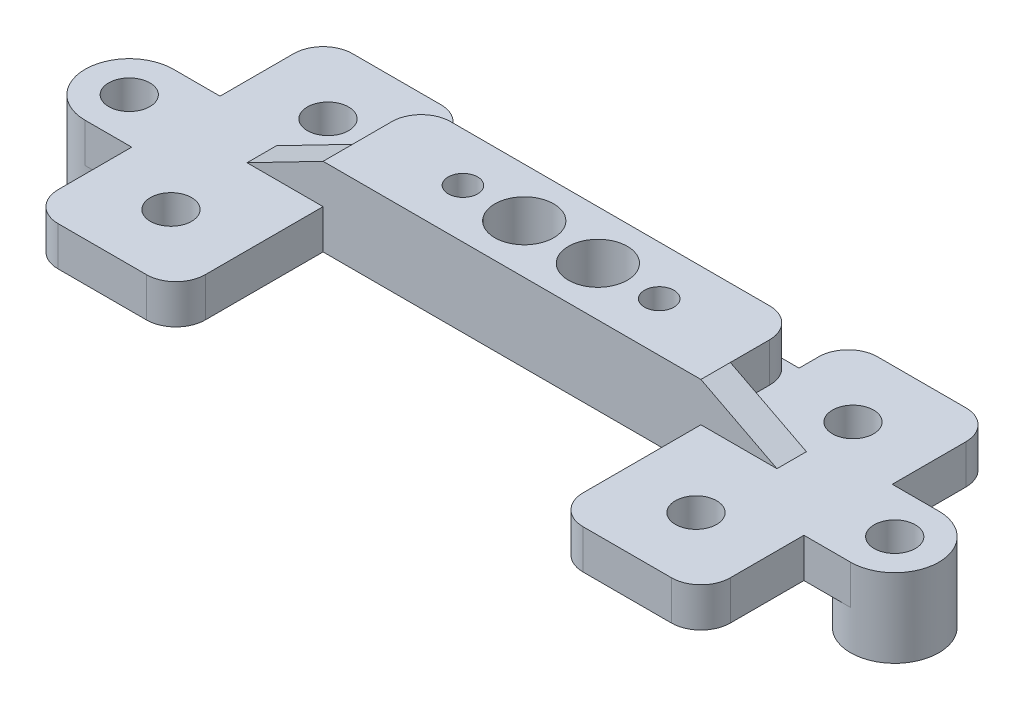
ISO-10303-21;
HEADER;
FILE_DESCRIPTION(('STEP AP214'),'2;1');
FILE_NAME('part.step','',(''),(''),'','','');
FILE_SCHEMA(('AUTOMOTIVE_DESIGN { 1 0 10303 214 1 1 1 1 }'));
ENDSEC;
DATA;
#1=APPLICATION_CONTEXT('core data for automotive mechanical design processes');
#2=APPLICATION_PROTOCOL_DEFINITION('international standard','automotive_design',2000,#1);
#3=PRODUCT_CONTEXT('',#1,'mechanical');
#4=PRODUCT('Part','Part','',(#3));
#5=PRODUCT_RELATED_PRODUCT_CATEGORY('part','',(#4));
#6=PRODUCT_DEFINITION_FORMATION('','',#4);
#7=PRODUCT_DEFINITION_CONTEXT('part definition',#1,'design');
#8=PRODUCT_DEFINITION('design','',#6,#7);
#9=PRODUCT_DEFINITION_SHAPE('','',#8);
#10=(LENGTH_UNIT() NAMED_UNIT(*) SI_UNIT(.MILLI.,.METRE.));
#11=(NAMED_UNIT(*) PLANE_ANGLE_UNIT() SI_UNIT($,.RADIAN.));
#12=(NAMED_UNIT(*) SI_UNIT($,.STERADIAN.) SOLID_ANGLE_UNIT());
#13=UNCERTAINTY_MEASURE_WITH_UNIT(LENGTH_MEASURE(1.E-05),#10,'distance_accuracy_value','');
#14=(GEOMETRIC_REPRESENTATION_CONTEXT(3) GLOBAL_UNCERTAINTY_ASSIGNED_CONTEXT((#13)) GLOBAL_UNIT_ASSIGNED_CONTEXT((#10,
#11,#12)) REPRESENTATION_CONTEXT('',''));
#15=CARTESIAN_POINT('',(0.,0.,0.));
#16=DIRECTION('',(0.,0.,1.));
#17=DIRECTION('',(1.,0.,0.));
#18=AXIS2_PLACEMENT_3D('',#15,#16,#17);
#19=CARTESIAN_POINT('',(0.,0.,-3.));
#20=DIRECTION('',(0.,0.,1.));
#21=DIRECTION('',(1.,0.,0.));
#22=AXIS2_PLACEMENT_3D('',#19,#20,#21);
#23=PLANE('',#22);
#24=DIRECTION('',(-0.888620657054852,-0.458642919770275,0.));
#25=VECTOR('',#24,1.);
#26=CARTESIAN_POINT('',(-19.25,8.,-3.));
#27=LINE('',#26,#25);
#28=CARTESIAN_POINT('',(-19.25,8.,-3.));
#29=VERTEX_POINT('',#28);
#30=CARTESIAN_POINT('',(-27.,3.99999999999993,-3.));
#31=VERTEX_POINT('',#30);
#32=EDGE_CURVE('E436',#29,#31,#27,.T.);
#33=ORIENTED_EDGE('',*,*,#32,.F.);
#34=DIRECTION('',(0.,1.,0.));
#35=VECTOR('',#34,1.);
#36=CARTESIAN_POINT('',(-19.25,8.,-3.));
#37=LINE('',#36,#35);
#38=CARTESIAN_POINT('',(-19.25,4.,-3.));
#39=VERTEX_POINT('',#38);
#40=EDGE_CURVE('E446',#39,#29,#37,.T.);
#41=ORIENTED_EDGE('',*,*,#40,.F.);
#42=DIRECTION('',(1.,0.,0.));
#43=VECTOR('',#42,1.);
#44=CARTESIAN_POINT('',(0.,4.,-3.));
#45=LINE('',#44,#43);
#46=EDGE_CURVE('E442',#31,#39,#45,.T.);
#47=ORIENTED_EDGE('',*,*,#46,.F.);
#48=EDGE_LOOP('',(#33,#41,#47));
#49=FACE_BOUND('',#48,.T.);
#50=ADVANCED_FACE('F16',(#49),#23,.F.);
#51=CARTESIAN_POINT('',(-19.25,8.,0.));
#52=DIRECTION('',(-1.,0.,0.));
#53=DIRECTION('',(0.,0.,1.));
#54=AXIS2_PLACEMENT_3D('',#51,#52,#53);
#55=PLANE('',#54);
#56=ORIENTED_EDGE('',*,*,#40,.T.);
#57=DIRECTION('',(0.,0.,1.));
#58=VECTOR('',#57,1.);
#59=CARTESIAN_POINT('',(-19.25,8.,0.));
#60=LINE('',#59,#58);
#61=CARTESIAN_POINT('',(-19.25,8.,-7.));
#62=VERTEX_POINT('',#61);
#63=EDGE_CURVE('E283',#62,#29,#60,.T.);
#64=ORIENTED_EDGE('',*,*,#63,.F.);
#65=DIRECTION('',(0.,1.,0.));
#66=VECTOR('',#65,1.);
#67=CARTESIAN_POINT('',(-19.25,-19.6432,-7.));
#68=LINE('',#67,#66);
#69=CARTESIAN_POINT('',(-19.25,4.,-7.));
#70=VERTEX_POINT('',#69);
#71=EDGE_CURVE('E262',#70,#62,#68,.T.);
#72=ORIENTED_EDGE('',*,*,#71,.F.);
#73=DIRECTION('',(0.,0.,1.));
#74=VECTOR('',#73,1.);
#75=CARTESIAN_POINT('',(-19.25,4.,0.));
#76=LINE('',#75,#74);
#77=EDGE_CURVE('E292',#39,#70,#76,.F.);
#78=ORIENTED_EDGE('',*,*,#77,.F.);
#79=EDGE_LOOP('',(#56,#64,#72,#78));
#80=FACE_BOUND('',#79,.T.);
#81=ADVANCED_FACE('F743',(#80),#55,.T.);
#82=CARTESIAN_POINT('',(-39.,-5.2,0.));
#83=DIRECTION('',(0.,1.,0.));
#84=DIRECTION('',(0.,0.,1.));
#85=AXIS2_PLACEMENT_3D('',#82,#83,#84);
#86=CYLINDRICAL_SURFACE('',#85,2.1);
#87=CARTESIAN_POINT('',(-39.,4.,0.));
#88=DIRECTION('',(0.,1.,0.));
#89=DIRECTION('',(0.,0.,1.));
#90=AXIS2_PLACEMENT_3D('',#87,#88,#89);
#91=CIRCLE('',#90,2.1);
#92=CARTESIAN_POINT('',(-39.,4.,2.1));
#93=VERTEX_POINT('',#92);
#94=EDGE_CURVE('E291',#93,#93,#91,.F.);
#95=ORIENTED_EDGE('',*,*,#94,.F.);
#96=EDGE_LOOP('',(#95));
#97=FACE_BOUND('',#96,.T.);
#98=CARTESIAN_POINT('',(-39.,-4.,0.));
#99=DIRECTION('',(0.,1.,0.));
#100=DIRECTION('',(0.,0.,1.));
#101=AXIS2_PLACEMENT_3D('',#98,#99,#100);
#102=CIRCLE('',#101,2.1);
#103=CARTESIAN_POINT('',(-39.,-4.,2.1));
#104=VERTEX_POINT('',#103);
#105=EDGE_CURVE('E280',#104,#104,#102,.F.);
#106=ORIENTED_EDGE('',*,*,#105,.T.);
#107=EDGE_LOOP('',(#106));
#108=FACE_BOUND('',#107,.T.);
#109=ADVANCED_FACE('F946',(#97,#108),#86,.F.);
#110=CARTESIAN_POINT('',(19.25,0.,0.));
#111=DIRECTION('',(1.,0.,0.));
#112=DIRECTION('',(0.,0.,-1.));
#113=AXIS2_PLACEMENT_3D('',#110,#111,#112);
#114=PLANE('',#113);
#115=DIRECTION('',(0.,1.,0.));
#116=VECTOR('',#115,1.);
#117=CARTESIAN_POINT('',(19.25,0.,-3.));
#118=LINE('',#117,#116);
#119=CARTESIAN_POINT('',(19.25,8.00000000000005,-3.));
#120=VERTEX_POINT('',#119);
#121=CARTESIAN_POINT('',(19.25,4.,-3.));
#122=VERTEX_POINT('',#121);
#123=EDGE_CURVE('E439',#120,#122,#118,.F.);
#124=ORIENTED_EDGE('',*,*,#123,.T.);
#125=DIRECTION('',(0.,0.,1.));
#126=VECTOR('',#125,1.);
#127=CARTESIAN_POINT('',(19.25,4.,0.));
#128=LINE('',#127,#126);
#129=CARTESIAN_POINT('',(19.25,4.,-7.));
#130=VERTEX_POINT('',#129);
#131=EDGE_CURVE('E258',#130,#122,#128,.T.);
#132=ORIENTED_EDGE('',*,*,#131,.F.);
#133=DIRECTION('',(0.,-1.,0.));
#134=VECTOR('',#133,1.);
#135=CARTESIAN_POINT('',(19.25,23.6432,-7.));
#136=LINE('',#135,#134);
#137=CARTESIAN_POINT('',(19.25,8.,-7.));
#138=VERTEX_POINT('',#137);
#139=EDGE_CURVE('E253',#138,#130,#136,.T.);
#140=ORIENTED_EDGE('',*,*,#139,.F.);
#141=DIRECTION('',(0.,0.,1.));
#142=VECTOR('',#141,1.);
#143=CARTESIAN_POINT('',(19.25,8.,0.));
#144=LINE('',#143,#142);
#145=EDGE_CURVE('E257',#120,#138,#144,.F.);
#146=ORIENTED_EDGE('',*,*,#145,.F.);
#147=EDGE_LOOP('',(#124,#132,#140,#146));
#148=FACE_BOUND('',#147,.T.);
#149=ADVANCED_FACE('F256',(#148),#114,.T.);
#150=CARTESIAN_POINT('',(0.,0.,-3.));
#151=DIRECTION('',(0.,0.,1.));
#152=DIRECTION('',(1.,0.,0.));
#153=AXIS2_PLACEMENT_3D('',#150,#151,#152);
#154=PLANE('',#153);
#155=ORIENTED_EDGE('',*,*,#123,.F.);
#156=DIRECTION('',(-0.888620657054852,0.458642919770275,0.));
#157=VECTOR('',#156,1.);
#158=CARTESIAN_POINT('',(27.,4.,-3.));
#159=LINE('',#158,#157);
#160=CARTESIAN_POINT('',(27.,4.,-3.));
#161=VERTEX_POINT('',#160);
#162=EDGE_CURVE('E438',#161,#120,#159,.T.);
#163=ORIENTED_EDGE('',*,*,#162,.F.);
#164=DIRECTION('',(1.,0.,0.));
#165=VECTOR('',#164,1.);
#166=CARTESIAN_POINT('',(0.,4.,-3.));
#167=LINE('',#166,#165);
#168=EDGE_CURVE('E454',#122,#161,#167,.T.);
#169=ORIENTED_EDGE('',*,*,#168,.F.);
#170=EDGE_LOOP('',(#155,#163,#169));
#171=FACE_BOUND('',#170,.T.);
#172=ADVANCED_FACE('F731',(#171),#154,.F.);
#173=CARTESIAN_POINT('',(39.,-5.2,0.));
#174=DIRECTION('',(0.,1.,0.));
#175=DIRECTION('',(0.,0.,1.));
#176=AXIS2_PLACEMENT_3D('',#173,#174,#175);
#177=CYLINDRICAL_SURFACE('',#176,2.1);
#178=CARTESIAN_POINT('',(39.,4.,0.));
#179=DIRECTION('',(0.,1.,0.));
#180=DIRECTION('',(0.,0.,1.));
#181=AXIS2_PLACEMENT_3D('',#178,#179,#180);
#182=CIRCLE('',#181,2.1);
#183=CARTESIAN_POINT('',(39.,4.,2.1));
#184=VERTEX_POINT('',#183);
#185=EDGE_CURVE('E300',#184,#184,#182,.F.);
#186=ORIENTED_EDGE('',*,*,#185,.F.);
#187=EDGE_LOOP('',(#186));
#188=FACE_BOUND('',#187,.T.);
#189=CARTESIAN_POINT('',(39.,-4.,0.));
#190=DIRECTION('',(0.,1.,0.));
#191=DIRECTION('',(0.,0.,1.));
#192=AXIS2_PLACEMENT_3D('',#189,#190,#191);
#193=CIRCLE('',#192,2.1);
#194=CARTESIAN_POINT('',(39.,-4.,2.1));
#195=VERTEX_POINT('',#194);
#196=EDGE_CURVE('E20',#195,#195,#193,.F.);
#197=ORIENTED_EDGE('',*,*,#196,.T.);
#198=EDGE_LOOP('',(#197));
#199=FACE_BOUND('',#198,.T.);
#200=ADVANCED_FACE('F1202',(#188,#199),#177,.F.);
#201=CARTESIAN_POINT('',(-19.25,8.,0.));
#202=DIRECTION('',(-0.458642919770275,0.888620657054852,0.));
#203=DIRECTION('',(-0.888620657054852,-0.458642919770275,0.));
#204=AXIS2_PLACEMENT_3D('',#201,#202,#203);
#205=PLANE('',#204);
#206=DIRECTION('',(0.,0.,1.));
#207=VECTOR('',#206,1.);
#208=CARTESIAN_POINT('',(-19.25,8.,0.));
#209=LINE('',#208,#207);
#210=CARTESIAN_POINT('',(-19.25,8.,0.));
#211=VERTEX_POINT('',#210);
#212=EDGE_CURVE('E464',#29,#211,#209,.T.);
#213=ORIENTED_EDGE('',*,*,#212,.F.);
#214=ORIENTED_EDGE('',*,*,#32,.T.);
#215=DIRECTION('',(0.,0.,1.));
#216=VECTOR('',#215,1.);
#217=CARTESIAN_POINT('',(-27.,4.,0.));
#218=LINE('',#217,#216);
#219=CARTESIAN_POINT('',(-27.,4.,0.));
#220=VERTEX_POINT('',#219);
#221=EDGE_CURVE('E288',#220,#31,#218,.F.);
#222=ORIENTED_EDGE('',*,*,#221,.F.);
#223=DIRECTION('',(-0.888620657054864,-0.458642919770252,0.));
#224=VECTOR('',#223,1.);
#225=CARTESIAN_POINT('',(-19.25,8.,0.));
#226=LINE('',#225,#224);
#227=EDGE_CURVE('E473',#211,#220,#226,.T.);
#228=ORIENTED_EDGE('',*,*,#227,.F.);
#229=EDGE_LOOP('',(#213,#214,#222,#228));
#230=FACE_BOUND('',#229,.T.);
#231=ADVANCED_FACE('F717',(#230),#205,.T.);
#232=CARTESIAN_POINT('',(27.,4.,0.));
#233=DIRECTION('',(0.458642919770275,0.888620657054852,0.));
#234=DIRECTION('',(-0.888620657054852,0.458642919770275,0.));
#235=AXIS2_PLACEMENT_3D('',#232,#233,#234);
#236=PLANE('',#235);
#237=DIRECTION('',(0.,0.,1.));
#238=VECTOR('',#237,1.);
#239=CARTESIAN_POINT('',(19.25,8.,0.));
#240=LINE('',#239,#238);
#241=CARTESIAN_POINT('',(19.25,8.,0.));
#242=VERTEX_POINT('',#241);
#243=EDGE_CURVE('E272',#242,#120,#240,.F.);
#244=ORIENTED_EDGE('',*,*,#243,.F.);
#245=DIRECTION('',(-0.888620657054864,0.458642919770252,0.));
#246=VECTOR('',#245,1.);
#247=CARTESIAN_POINT('',(27.,4.,0.));
#248=LINE('',#247,#246);
#249=CARTESIAN_POINT('',(27.,4.,0.));
#250=VERTEX_POINT('',#249);
#251=EDGE_CURVE('E494',#250,#242,#248,.T.);
#252=ORIENTED_EDGE('',*,*,#251,.F.);
#253=DIRECTION('',(0.,0.,1.));
#254=VECTOR('',#253,1.);
#255=CARTESIAN_POINT('',(27.,4.,0.));
#256=LINE('',#255,#254);
#257=EDGE_CURVE('E298',#161,#250,#256,.T.);
#258=ORIENTED_EDGE('',*,*,#257,.F.);
#259=ORIENTED_EDGE('',*,*,#162,.T.);
#260=EDGE_LOOP('',(#244,#252,#258,#259));
#261=FACE_BOUND('',#260,.T.);
#262=ADVANCED_FACE('F727',(#261),#236,.T.);
#263=CARTESIAN_POINT('',(0.,-4.,0.));
#264=DIRECTION('',(0.,1.,0.));
#265=DIRECTION('',(0.,0.,1.));
#266=AXIS2_PLACEMENT_3D('',#263,#264,#265);
#267=PLANE('',#266);
#268=ORIENTED_EDGE('',*,*,#196,.F.);
#269=EDGE_LOOP('',(#268));
#270=FACE_BOUND('',#269,.T.);
#271=CARTESIAN_POINT('',(39.,-4.,0.));
#272=DIRECTION('',(0.,1.,0.));
#273=DIRECTION('',(0.,0.,1.));
#274=AXIS2_PLACEMENT_3D('',#271,#272,#273);
#275=CIRCLE('',#274,4.5);
#276=CARTESIAN_POINT('',(39.,-4.,4.5));
#277=VERTEX_POINT('',#276);
#278=EDGE_CURVE('E318',#277,#277,#275,.T.);
#279=ORIENTED_EDGE('',*,*,#278,.F.);
#280=EDGE_LOOP('',(#279));
#281=FACE_BOUND('',#280,.T.);
#282=ADVANCED_FACE('F1182',(#270,#281),#267,.F.);
#283=CARTESIAN_POINT('',(16.25,23.6432,-7.));
#284=DIRECTION('',(0.,-1.,0.));
#285=DIRECTION('',(0.,0.,-1.));
#286=AXIS2_PLACEMENT_3D('',#283,#284,#285);
#287=CYLINDRICAL_SURFACE('',#286,3.);
#288=DIRECTION('',(0.,1.,0.));
#289=VECTOR('',#288,1.);
#290=CARTESIAN_POINT('',(16.25,0.,-10.));
#291=LINE('',#290,#289);
#292=CARTESIAN_POINT('',(16.25,4.,-10.));
#293=VERTEX_POINT('',#292);
#294=CARTESIAN_POINT('',(16.25,8.,-10.));
#295=VERTEX_POINT('',#294);
#296=EDGE_CURVE('E278',#293,#295,#291,.T.);
#297=ORIENTED_EDGE('',*,*,#296,.T.);
#298=CARTESIAN_POINT('',(16.25,8.,-7.));
#299=DIRECTION('',(0.,-1.,0.));
#300=DIRECTION('',(0.,0.,-1.));
#301=AXIS2_PLACEMENT_3D('',#298,#299,#300);
#302=CIRCLE('',#301,3.);
#303=EDGE_CURVE('E269',#138,#295,#302,.F.);
#304=ORIENTED_EDGE('',*,*,#303,.F.);
#305=ORIENTED_EDGE('',*,*,#139,.T.);
#306=CARTESIAN_POINT('',(16.25,4.,-7.));
#307=DIRECTION('',(0.,-1.,0.));
#308=DIRECTION('',(0.,0.,-1.));
#309=AXIS2_PLACEMENT_3D('',#306,#307,#308);
#310=CIRCLE('',#309,3.);
#311=EDGE_CURVE('E297',#293,#130,#310,.T.);
#312=ORIENTED_EDGE('',*,*,#311,.F.);
#313=EDGE_LOOP('',(#297,#304,#305,#312));
#314=FACE_BOUND('',#313,.T.);
#315=ADVANCED_FACE('F276',(#314),#287,.T.);
#316=CARTESIAN_POINT('',(-16.25,-19.6432,-7.));
#317=DIRECTION('',(0.,1.,0.));
#318=DIRECTION('',(0.,0.,1.));
#319=AXIS2_PLACEMENT_3D('',#316,#317,#318);
#320=CYLINDRICAL_SURFACE('',#319,3.);
#321=CARTESIAN_POINT('',(-16.25,4.,-7.));
#322=DIRECTION('',(0.,1.,0.));
#323=DIRECTION('',(0.,0.,1.));
#324=AXIS2_PLACEMENT_3D('',#321,#322,#323);
#325=CIRCLE('',#324,3.);
#326=CARTESIAN_POINT('',(-16.25,4.,-10.));
#327=VERTEX_POINT('',#326);
#328=EDGE_CURVE('E289',#70,#327,#325,.F.);
#329=ORIENTED_EDGE('',*,*,#328,.F.);
#330=ORIENTED_EDGE('',*,*,#71,.T.);
#331=CARTESIAN_POINT('',(-16.25,8.,-7.));
#332=DIRECTION('',(0.,1.,0.));
#333=DIRECTION('',(0.,0.,1.));
#334=AXIS2_PLACEMENT_3D('',#331,#332,#333);
#335=CIRCLE('',#334,3.);
#336=CARTESIAN_POINT('',(-16.25,8.,-10.));
#337=VERTEX_POINT('',#336);
#338=EDGE_CURVE('E279',#337,#62,#335,.T.);
#339=ORIENTED_EDGE('',*,*,#338,.F.);
#340=DIRECTION('',(0.,1.,0.));
#341=VECTOR('',#340,1.);
#342=CARTESIAN_POINT('',(-16.25,0.,-10.));
#343=LINE('',#342,#341);
#344=EDGE_CURVE('E548',#337,#327,#343,.F.);
#345=ORIENTED_EDGE('',*,*,#344,.T.);
#346=EDGE_LOOP('',(#329,#330,#339,#345));
#347=FACE_BOUND('',#346,.T.);
#348=ADVANCED_FACE('F742',(#347),#320,.T.);
#349=CARTESIAN_POINT('',(0.,-4.,0.));
#350=DIRECTION('',(0.,1.,0.));
#351=DIRECTION('',(0.,0.,1.));
#352=AXIS2_PLACEMENT_3D('',#349,#350,#351);
#353=PLANE('',#352);
#354=ORIENTED_EDGE('',*,*,#105,.F.);
#355=EDGE_LOOP('',(#354));
#356=FACE_BOUND('',#355,.T.);
#357=CARTESIAN_POINT('',(-39.,-4.,0.));
#358=DIRECTION('',(0.,1.,0.));
#359=DIRECTION('',(0.,0.,1.));
#360=AXIS2_PLACEMENT_3D('',#357,#358,#359);
#361=CIRCLE('',#360,4.5);
#362=CARTESIAN_POINT('',(-39.,-4.,4.5));
#363=VERTEX_POINT('',#362);
#364=EDGE_CURVE('E339',#363,#363,#361,.T.);
#365=ORIENTED_EDGE('',*,*,#364,.F.);
#366=EDGE_LOOP('',(#365));
#367=FACE_BOUND('',#366,.T.);
#368=ADVANCED_FACE('F952',(#356,#367),#353,.F.);
#369=CARTESIAN_POINT('',(19.25,8.,0.));
#370=DIRECTION('',(0.,1.,0.));
#371=DIRECTION('',(0.,0.,1.));
#372=AXIS2_PLACEMENT_3D('',#369,#370,#371);
#373=PLANE('',#372);
#374=CARTESIAN_POINT('',(3.75,8.,-5.));
#375=DIRECTION('',(0.,1.,0.));
#376=DIRECTION('',(0.,0.,1.));
#377=AXIS2_PLACEMENT_3D('',#374,#375,#376);
#378=CIRCLE('',#377,3.);
#379=CARTESIAN_POINT('',(3.75,8.,-2.));
#380=VERTEX_POINT('',#379);
#381=EDGE_CURVE('E353',#380,#380,#378,.F.);
#382=ORIENTED_EDGE('',*,*,#381,.T.);
#383=EDGE_LOOP('',(#382));
#384=FACE_BOUND('',#383,.T.);
#385=CARTESIAN_POINT('',(10.,8.,-5.));
#386=DIRECTION('',(0.,1.,0.));
#387=DIRECTION('',(0.,0.,1.));
#388=AXIS2_PLACEMENT_3D('',#385,#386,#387);
#389=CIRCLE('',#388,1.5);
#390=CARTESIAN_POINT('',(10.,8.,-3.5));
#391=VERTEX_POINT('',#390);
#392=EDGE_CURVE('E350',#391,#391,#389,.F.);
#393=ORIENTED_EDGE('',*,*,#392,.T.);
#394=EDGE_LOOP('',(#393));
#395=FACE_BOUND('',#394,.T.);
#396=CARTESIAN_POINT('',(-3.75,8.,-5.));
#397=DIRECTION('',(0.,1.,0.));
#398=DIRECTION('',(0.,0.,1.));
#399=AXIS2_PLACEMENT_3D('',#396,#397,#398);
#400=CIRCLE('',#399,3.);
#401=CARTESIAN_POINT('',(-3.75,8.,-2.));
#402=VERTEX_POINT('',#401);
#403=EDGE_CURVE('E347',#402,#402,#400,.F.);
#404=ORIENTED_EDGE('',*,*,#403,.T.);
#405=EDGE_LOOP('',(#404));
#406=FACE_BOUND('',#405,.T.);
#407=CARTESIAN_POINT('',(-10.,8.,-5.));
#408=DIRECTION('',(0.,1.,0.));
#409=DIRECTION('',(0.,0.,1.));
#410=AXIS2_PLACEMENT_3D('',#407,#408,#409);
#411=CIRCLE('',#410,1.5);
#412=CARTESIAN_POINT('',(-10.,8.,-3.5));
#413=VERTEX_POINT('',#412);
#414=EDGE_CURVE('E344',#413,#413,#411,.F.);
#415=ORIENTED_EDGE('',*,*,#414,.T.);
#416=EDGE_LOOP('',(#415));
#417=FACE_BOUND('',#416,.T.);
#418=ORIENTED_EDGE('',*,*,#243,.T.);
#419=ORIENTED_EDGE('',*,*,#145,.T.);
#420=ORIENTED_EDGE('',*,*,#303,.T.);
#421=DIRECTION('',(1.,0.,0.));
#422=VECTOR('',#421,1.);
#423=CARTESIAN_POINT('',(0.,8.,-10.));
#424=LINE('',#423,#422);
#425=EDGE_CURVE('E546',#295,#337,#424,.F.);
#426=ORIENTED_EDGE('',*,*,#425,.T.);
#427=ORIENTED_EDGE('',*,*,#338,.T.);
#428=ORIENTED_EDGE('',*,*,#63,.T.);
#429=ORIENTED_EDGE('',*,*,#212,.T.);
#430=DIRECTION('',(1.,0.,0.));
#431=VECTOR('',#430,1.);
#432=CARTESIAN_POINT('',(0.,8.,0.));
#433=LINE('',#432,#431);
#434=EDGE_CURVE('E470',#242,#211,#433,.F.);
#435=ORIENTED_EDGE('',*,*,#434,.F.);
#436=EDGE_LOOP('',(#418,#419,#420,#426,#427,#428,#429,#435));
#437=FACE_BOUND('',#436,.T.);
#438=ADVANCED_FACE('F267',(#384,#395,#406,#417,#437),#373,.T.);
#439=CARTESIAN_POINT('',(0.,4.,0.));
#440=DIRECTION('',(0.,1.,0.));
#441=DIRECTION('',(0.,0.,1.));
#442=AXIS2_PLACEMENT_3D('',#439,#440,#441);
#443=PLANE('',#442);
#444=CARTESIAN_POINT('',(-26.75,4.,-8.));
#445=DIRECTION('',(0.,1.,0.));
#446=DIRECTION('',(0.,0.,1.));
#447=AXIS2_PLACEMENT_3D('',#444,#445,#446);
#448=CIRCLE('',#447,2.1);
#449=CARTESIAN_POINT('',(-26.75,4.,-5.9));
#450=VERTEX_POINT('',#449);
#451=EDGE_CURVE('E362',#450,#450,#448,.F.);
#452=ORIENTED_EDGE('',*,*,#451,.T.);
#453=EDGE_LOOP('',(#452));
#454=FACE_BOUND('',#453,.T.);
#455=CARTESIAN_POINT('',(-26.75,4.,8.));
#456=DIRECTION('',(0.,1.,0.));
#457=DIRECTION('',(0.,0.,1.));
#458=AXIS2_PLACEMENT_3D('',#455,#456,#457);
#459=CIRCLE('',#458,2.1);
#460=CARTESIAN_POINT('',(-26.75,4.,10.1));
#461=VERTEX_POINT('',#460);
#462=EDGE_CURVE('E359',#461,#461,#459,.F.);
#463=ORIENTED_EDGE('',*,*,#462,.T.);
#464=EDGE_LOOP('',(#463));
#465=FACE_BOUND('',#464,.T.);
#466=ORIENTED_EDGE('',*,*,#94,.T.);
#467=EDGE_LOOP('',(#466));
#468=FACE_BOUND('',#467,.T.);
#469=ORIENTED_EDGE('',*,*,#328,.T.);
#470=DIRECTION('',(1.,0.,0.));
#471=VECTOR('',#470,1.);
#472=CARTESIAN_POINT('',(0.,4.,-10.));
#473=LINE('',#472,#471);
#474=CARTESIAN_POINT('',(-19.25,4.,-10.));
#475=VERTEX_POINT('',#474);
#476=EDGE_CURVE('E551',#327,#475,#473,.F.);
#477=ORIENTED_EDGE('',*,*,#476,.T.);
#478=DIRECTION('',(0.,0.,-1.));
#479=VECTOR('',#478,1.);
#480=CARTESIAN_POINT('',(-19.25,4.,15.));
#481=LINE('',#480,#479);
#482=CARTESIAN_POINT('',(-19.25,4.,-12.));
#483=VERTEX_POINT('',#482);
#484=EDGE_CURVE('E556',#483,#475,#481,.F.);
#485=ORIENTED_EDGE('',*,*,#484,.F.);
#486=CARTESIAN_POINT('',(-22.25,4.,-12.));
#487=DIRECTION('',(0.,-1.,0.));
#488=DIRECTION('',(0.,0.,-1.));
#489=AXIS2_PLACEMENT_3D('',#486,#487,#488);
#490=CIRCLE('',#489,3.);
#491=CARTESIAN_POINT('',(-22.25,4.,-15.));
#492=VERTEX_POINT('',#491);
#493=EDGE_CURVE('E331',#492,#483,#490,.T.);
#494=ORIENTED_EDGE('',*,*,#493,.F.);
#495=DIRECTION('',(-1.,0.,0.));
#496=VECTOR('',#495,1.);
#497=CARTESIAN_POINT('',(-19.25,4.,-15.));
#498=LINE('',#497,#496);
#499=CARTESIAN_POINT('',(-31.25,4.,-15.));
#500=VERTEX_POINT('',#499);
#501=EDGE_CURVE('E560',#500,#492,#498,.F.);
#502=ORIENTED_EDGE('',*,*,#501,.F.);
#503=CARTESIAN_POINT('',(-31.25,4.,-12.));
#504=DIRECTION('',(0.,-1.,0.));
#505=DIRECTION('',(0.,0.,-1.));
#506=AXIS2_PLACEMENT_3D('',#503,#504,#505);
#507=CIRCLE('',#506,3.);
#508=CARTESIAN_POINT('',(-34.25,4.,-12.));
#509=VERTEX_POINT('',#508);
#510=EDGE_CURVE('E335',#509,#500,#507,.T.);
#511=ORIENTED_EDGE('',*,*,#510,.F.);
#512=DIRECTION('',(0.,0.,1.));
#513=VECTOR('',#512,1.);
#514=CARTESIAN_POINT('',(-34.25,4.,-15.));
#515=LINE('',#514,#513);
#516=CARTESIAN_POINT('',(-34.25,4.,-4.5));
#517=VERTEX_POINT('',#516);
#518=EDGE_CURVE('E569',#517,#509,#515,.F.);
#519=ORIENTED_EDGE('',*,*,#518,.F.);
#520=DIRECTION('',(-1.,0.,0.));
#521=VECTOR('',#520,1.);
#522=CARTESIAN_POINT('',(-34.25,4.,-4.5));
#523=LINE('',#522,#521);
#524=CARTESIAN_POINT('',(-39.,4.,-4.5));
#525=VERTEX_POINT('',#524);
#526=EDGE_CURVE('E564',#525,#517,#523,.F.);
#527=ORIENTED_EDGE('',*,*,#526,.F.);
#528=CARTESIAN_POINT('',(-39.,4.,0.));
#529=DIRECTION('',(0.,1.,0.));
#530=DIRECTION('',(0.,0.,1.));
#531=AXIS2_PLACEMENT_3D('',#528,#529,#530);
#532=CIRCLE('',#531,4.5);
#533=CARTESIAN_POINT('',(-39.,4.,4.5));
#534=VERTEX_POINT('',#533);
#535=EDGE_CURVE('E273',#525,#534,#532,.T.);
#536=ORIENTED_EDGE('',*,*,#535,.T.);
#537=DIRECTION('',(1.,0.,0.));
#538=VECTOR('',#537,1.);
#539=CARTESIAN_POINT('',(-39.,4.,4.5));
#540=LINE('',#539,#538);
#541=CARTESIAN_POINT('',(-34.25,4.,4.5));
#542=VERTEX_POINT('',#541);
#543=EDGE_CURVE('E580',#542,#534,#540,.F.);
#544=ORIENTED_EDGE('',*,*,#543,.F.);
#545=DIRECTION('',(0.,0.,1.));
#546=VECTOR('',#545,1.);
#547=CARTESIAN_POINT('',(-34.25,4.,-15.));
#548=LINE('',#547,#546);
#549=CARTESIAN_POINT('',(-34.25,4.,12.));
#550=VERTEX_POINT('',#549);
#551=EDGE_CURVE('E575',#550,#542,#548,.F.);
#552=ORIENTED_EDGE('',*,*,#551,.F.);
#553=CARTESIAN_POINT('',(-31.25,4.,12.));
#554=DIRECTION('',(0.,-1.,0.));
#555=DIRECTION('',(0.,0.,-1.));
#556=AXIS2_PLACEMENT_3D('',#553,#554,#555);
#557=CIRCLE('',#556,3.);
#558=CARTESIAN_POINT('',(-31.25,4.,15.));
#559=VERTEX_POINT('',#558);
#560=EDGE_CURVE('E303',#559,#550,#557,.T.);
#561=ORIENTED_EDGE('',*,*,#560,.F.);
#562=DIRECTION('',(1.,0.,0.));
#563=VECTOR('',#562,1.);
#564=CARTESIAN_POINT('',(-34.25,4.,15.));
#565=LINE('',#564,#563);
#566=CARTESIAN_POINT('',(-22.25,4.,15.));
#567=VERTEX_POINT('',#566);
#568=EDGE_CURVE('E305',#567,#559,#565,.F.);
#569=ORIENTED_EDGE('',*,*,#568,.F.);
#570=CARTESIAN_POINT('',(-22.25,4.,12.));
#571=DIRECTION('',(0.,-1.,0.));
#572=DIRECTION('',(0.,0.,-1.));
#573=AXIS2_PLACEMENT_3D('',#570,#571,#572);
#574=CIRCLE('',#573,3.);
#575=CARTESIAN_POINT('',(-19.25,4.,12.));
#576=VERTEX_POINT('',#575);
#577=EDGE_CURVE('E306',#576,#567,#574,.T.);
#578=ORIENTED_EDGE('',*,*,#577,.F.);
#579=DIRECTION('',(0.,0.,-1.));
#580=VECTOR('',#579,1.);
#581=CARTESIAN_POINT('',(-19.25,4.,15.));
#582=LINE('',#581,#580);
#583=CARTESIAN_POINT('',(-19.25,4.,0.));
#584=VERTEX_POINT('',#583);
#585=EDGE_CURVE('E474',#584,#576,#582,.F.);
#586=ORIENTED_EDGE('',*,*,#585,.F.);
#587=DIRECTION('',(1.,0.,0.));
#588=VECTOR('',#587,1.);
#589=CARTESIAN_POINT('',(0.,4.,0.));
#590=LINE('',#589,#588);
#591=EDGE_CURVE('E478',#220,#584,#590,.T.);
#592=ORIENTED_EDGE('',*,*,#591,.F.);
#593=ORIENTED_EDGE('',*,*,#221,.T.);
#594=ORIENTED_EDGE('',*,*,#46,.T.);
#595=ORIENTED_EDGE('',*,*,#77,.T.);
#596=EDGE_LOOP('',(#469,#477,#485,#494,#502,#511,#519,#527,#536,#544,#552,#561,#569,#578,#586,
#592,#593,#594,#595));
#597=FACE_BOUND('',#596,.T.);
#598=ADVANCED_FACE('F745',(#454,#465,#468,#597),#443,.T.);
#599=CARTESIAN_POINT('',(0.,4.,0.));
#600=DIRECTION('',(0.,1.,0.));
#601=DIRECTION('',(0.,0.,1.));
#602=AXIS2_PLACEMENT_3D('',#599,#600,#601);
#603=PLANE('',#602);
#604=ORIENTED_EDGE('',*,*,#185,.T.);
#605=EDGE_LOOP('',(#604));
#606=FACE_BOUND('',#605,.T.);
#607=CARTESIAN_POINT('',(26.75,4.,-8.));
#608=DIRECTION('',(0.,1.,0.));
#609=DIRECTION('',(0.,0.,1.));
#610=AXIS2_PLACEMENT_3D('',#607,#608,#609);
#611=CIRCLE('',#610,2.1);
#612=CARTESIAN_POINT('',(26.75,4.,-5.9));
#613=VERTEX_POINT('',#612);
#614=EDGE_CURVE('E365',#613,#613,#611,.F.);
#615=ORIENTED_EDGE('',*,*,#614,.T.);
#616=EDGE_LOOP('',(#615));
#617=FACE_BOUND('',#616,.T.);
#618=CARTESIAN_POINT('',(26.75,4.,8.));
#619=DIRECTION('',(0.,1.,0.));
#620=DIRECTION('',(0.,0.,1.));
#621=AXIS2_PLACEMENT_3D('',#618,#619,#620);
#622=CIRCLE('',#621,2.1);
#623=CARTESIAN_POINT('',(26.75,4.,10.1));
#624=VERTEX_POINT('',#623);
#625=EDGE_CURVE('E356',#624,#624,#622,.F.);
#626=ORIENTED_EDGE('',*,*,#625,.T.);
#627=EDGE_LOOP('',(#626));
#628=FACE_BOUND('',#627,.T.);
#629=DIRECTION('',(1.,0.,0.));
#630=VECTOR('',#629,1.);
#631=CARTESIAN_POINT('',(0.,4.,-10.));
#632=LINE('',#631,#630);
#633=CARTESIAN_POINT('',(19.25,4.,-10.));
#634=VERTEX_POINT('',#633);
#635=EDGE_CURVE('E542',#634,#293,#632,.F.);
#636=ORIENTED_EDGE('',*,*,#635,.T.);
#637=ORIENTED_EDGE('',*,*,#311,.T.);
#638=ORIENTED_EDGE('',*,*,#131,.T.);
#639=ORIENTED_EDGE('',*,*,#168,.T.);
#640=ORIENTED_EDGE('',*,*,#257,.T.);
#641=DIRECTION('',(1.,0.,0.));
#642=VECTOR('',#641,1.);
#643=CARTESIAN_POINT('',(0.,4.,0.));
#644=LINE('',#643,#642);
#645=CARTESIAN_POINT('',(19.25,4.,0.));
#646=VERTEX_POINT('',#645);
#647=EDGE_CURVE('E498',#646,#250,#644,.T.);
#648=ORIENTED_EDGE('',*,*,#647,.F.);
#649=DIRECTION('',(0.,0.,1.));
#650=VECTOR('',#649,1.);
#651=CARTESIAN_POINT('',(19.25,4.,-15.));
#652=LINE('',#651,#650);
#653=CARTESIAN_POINT('',(19.25,4.,12.));
#654=VERTEX_POINT('',#653);
#655=EDGE_CURVE('E497',#654,#646,#652,.F.);
#656=ORIENTED_EDGE('',*,*,#655,.F.);
#657=CARTESIAN_POINT('',(22.25,4.,12.));
#658=DIRECTION('',(0.,-1.,0.));
#659=DIRECTION('',(0.,0.,-1.));
#660=AXIS2_PLACEMENT_3D('',#657,#658,#659);
#661=CIRCLE('',#660,3.);
#662=CARTESIAN_POINT('',(22.25,4.,15.));
#663=VERTEX_POINT('',#662);
#664=EDGE_CURVE('E310',#663,#654,#661,.T.);
#665=ORIENTED_EDGE('',*,*,#664,.F.);
#666=DIRECTION('',(1.,0.,0.));
#667=VECTOR('',#666,1.);
#668=CARTESIAN_POINT('',(19.25,4.,15.));
#669=LINE('',#668,#667);
#670=CARTESIAN_POINT('',(31.25,4.,15.));
#671=VERTEX_POINT('',#670);
#672=EDGE_CURVE('E509',#671,#663,#669,.F.);
#673=ORIENTED_EDGE('',*,*,#672,.F.);
#674=CARTESIAN_POINT('',(31.25,4.,12.));
#675=DIRECTION('',(0.,-1.,0.));
#676=DIRECTION('',(0.,0.,-1.));
#677=AXIS2_PLACEMENT_3D('',#674,#675,#676);
#678=CIRCLE('',#677,3.);
#679=CARTESIAN_POINT('',(34.25,4.,12.));
#680=VERTEX_POINT('',#679);
#681=EDGE_CURVE('E314',#680,#671,#678,.T.);
#682=ORIENTED_EDGE('',*,*,#681,.F.);
#683=DIRECTION('',(0.,0.,-1.));
#684=VECTOR('',#683,1.);
#685=CARTESIAN_POINT('',(34.25,4.,15.));
#686=LINE('',#685,#684);
#687=CARTESIAN_POINT('',(34.25,4.,4.5));
#688=VERTEX_POINT('',#687);
#689=EDGE_CURVE('E518',#688,#680,#686,.F.);
#690=ORIENTED_EDGE('',*,*,#689,.F.);
#691=DIRECTION('',(1.,0.,0.));
#692=VECTOR('',#691,1.);
#693=CARTESIAN_POINT('',(34.25,4.,4.5));
#694=LINE('',#693,#692);
#695=CARTESIAN_POINT('',(39.,4.,4.5));
#696=VERTEX_POINT('',#695);
#697=EDGE_CURVE('E513',#696,#688,#694,.F.);
#698=ORIENTED_EDGE('',*,*,#697,.F.);
#699=CARTESIAN_POINT('',(39.,4.,0.));
#700=DIRECTION('',(0.,1.,0.));
#701=DIRECTION('',(0.,0.,1.));
#702=AXIS2_PLACEMENT_3D('',#699,#700,#701);
#703=CIRCLE('',#702,4.5);
#704=CARTESIAN_POINT('',(39.,4.,-4.5));
#705=VERTEX_POINT('',#704);
#706=EDGE_CURVE('E295',#696,#705,#703,.T.);
#707=ORIENTED_EDGE('',*,*,#706,.T.);
#708=DIRECTION('',(-1.,0.,0.));
#709=VECTOR('',#708,1.);
#710=CARTESIAN_POINT('',(39.,4.,-4.5));
#711=LINE('',#710,#709);
#712=CARTESIAN_POINT('',(34.25,4.,-4.5));
#713=VERTEX_POINT('',#712);
#714=EDGE_CURVE('E524',#713,#705,#711,.F.);
#715=ORIENTED_EDGE('',*,*,#714,.F.);
#716=DIRECTION('',(0.,0.,-1.));
#717=VECTOR('',#716,1.);
#718=CARTESIAN_POINT('',(34.25,4.,15.));
#719=LINE('',#718,#717);
#720=CARTESIAN_POINT('',(34.25,4.,-12.));
#721=VERTEX_POINT('',#720);
#722=EDGE_CURVE('E527',#721,#713,#719,.F.);
#723=ORIENTED_EDGE('',*,*,#722,.F.);
#724=CARTESIAN_POINT('',(31.25,4.,-12.));
#725=DIRECTION('',(0.,-1.,0.));
#726=DIRECTION('',(0.,0.,-1.));
#727=AXIS2_PLACEMENT_3D('',#724,#725,#726);
#728=CIRCLE('',#727,3.);
#729=CARTESIAN_POINT('',(31.25,4.,-15.));
#730=VERTEX_POINT('',#729);
#731=EDGE_CURVE('E323',#730,#721,#728,.T.);
#732=ORIENTED_EDGE('',*,*,#731,.F.);
#733=DIRECTION('',(-1.,0.,0.));
#734=VECTOR('',#733,1.);
#735=CARTESIAN_POINT('',(34.25,4.,-15.));
#736=LINE('',#735,#734);
#737=CARTESIAN_POINT('',(22.25,4.,-15.));
#738=VERTEX_POINT('',#737);
#739=EDGE_CURVE('E531',#738,#730,#736,.F.);
#740=ORIENTED_EDGE('',*,*,#739,.F.);
#741=CARTESIAN_POINT('',(22.25,4.,-12.));
#742=DIRECTION('',(0.,-1.,0.));
#743=DIRECTION('',(0.,0.,-1.));
#744=AXIS2_PLACEMENT_3D('',#741,#742,#743);
#745=CIRCLE('',#744,3.);
#746=CARTESIAN_POINT('',(19.25,4.,-12.));
#747=VERTEX_POINT('',#746);
#748=EDGE_CURVE('E327',#747,#738,#745,.T.);
#749=ORIENTED_EDGE('',*,*,#748,.F.);
#750=DIRECTION('',(0.,0.,1.));
#751=VECTOR('',#750,1.);
#752=CARTESIAN_POINT('',(19.25,4.,-15.));
#753=LINE('',#752,#751);
#754=EDGE_CURVE('E535',#634,#747,#753,.F.);
#755=ORIENTED_EDGE('',*,*,#754,.F.);
#756=EDGE_LOOP('',(#636,#637,#638,#639,#640,#648,#656,#665,#673,#682,#690,#698,#707,#715,#723,
#732,#740,#749,#755));
#757=FACE_BOUND('',#756,.T.);
#758=ADVANCED_FACE('F733',(#606,#617,#628,#757),#603,.T.);
#759=CARTESIAN_POINT('',(-31.25,23.6432,12.));
#760=DIRECTION('',(0.,-1.,0.));
#761=DIRECTION('',(0.,0.,-1.));
#762=AXIS2_PLACEMENT_3D('',#759,#760,#761);
#763=CYLINDRICAL_SURFACE('',#762,3.);
#764=ORIENTED_EDGE('',*,*,#560,.T.);
#765=DIRECTION('',(0.,1.,0.));
#766=VECTOR('',#765,1.);
#767=CARTESIAN_POINT('',(-34.25,0.,12.));
#768=LINE('',#767,#766);
#769=CARTESIAN_POINT('',(-34.25,0.,12.));
#770=VERTEX_POINT('',#769);
#771=EDGE_CURVE('E577',#770,#550,#768,.T.);
#772=ORIENTED_EDGE('',*,*,#771,.F.);
#773=CARTESIAN_POINT('',(-31.25,0.,12.));
#774=DIRECTION('',(0.,-1.,0.));
#775=DIRECTION('',(0.,0.,-1.));
#776=AXIS2_PLACEMENT_3D('',#773,#774,#775);
#777=CIRCLE('',#776,3.);
#778=CARTESIAN_POINT('',(-31.25,0.,15.));
#779=VERTEX_POINT('',#778);
#780=EDGE_CURVE('E368',#770,#779,#777,.F.);
#781=ORIENTED_EDGE('',*,*,#780,.T.);
#782=DIRECTION('',(0.,1.,0.));
#783=VECTOR('',#782,1.);
#784=CARTESIAN_POINT('',(-31.25,0.,15.));
#785=LINE('',#784,#783);
#786=EDGE_CURVE('E309',#559,#779,#785,.F.);
#787=ORIENTED_EDGE('',*,*,#786,.F.);
#788=EDGE_LOOP('',(#764,#772,#781,#787));
#789=FACE_BOUND('',#788,.T.);
#790=ADVANCED_FACE('F863',(#789),#763,.T.);
#791=CARTESIAN_POINT('',(-34.25,0.,15.));
#792=DIRECTION('',(0.,0.,1.));
#793=DIRECTION('',(1.,0.,0.));
#794=AXIS2_PLACEMENT_3D('',#791,#792,#793);
#795=PLANE('',#794);
#796=ORIENTED_EDGE('',*,*,#786,.T.);
#797=DIRECTION('',(1.,0.,0.));
#798=VECTOR('',#797,1.);
#799=CARTESIAN_POINT('',(0.,0.,15.));
#800=LINE('',#799,#798);
#801=CARTESIAN_POINT('',(-22.25,0.,15.));
#802=VERTEX_POINT('',#801);
#803=EDGE_CURVE('E371',#779,#802,#800,.T.);
#804=ORIENTED_EDGE('',*,*,#803,.T.);
#805=DIRECTION('',(0.,-1.,0.));
#806=VECTOR('',#805,1.);
#807=CARTESIAN_POINT('',(-22.25,23.6432,15.));
#808=LINE('',#807,#806);
#809=EDGE_CURVE('E308',#567,#802,#808,.T.);
#810=ORIENTED_EDGE('',*,*,#809,.F.);
#811=ORIENTED_EDGE('',*,*,#568,.T.);
#812=EDGE_LOOP('',(#796,#804,#810,#811));
#813=FACE_BOUND('',#812,.T.);
#814=ADVANCED_FACE('F865',(#813),#795,.T.);
#815=CARTESIAN_POINT('',(-22.25,23.6432,12.));
#816=DIRECTION('',(0.,-1.,0.));
#817=DIRECTION('',(0.,0.,-1.));
#818=AXIS2_PLACEMENT_3D('',#815,#816,#817);
#819=CYLINDRICAL_SURFACE('',#818,3.);
#820=ORIENTED_EDGE('',*,*,#577,.T.);
#821=ORIENTED_EDGE('',*,*,#809,.T.);
#822=CARTESIAN_POINT('',(-22.25,0.,12.));
#823=DIRECTION('',(0.,-1.,0.));
#824=DIRECTION('',(0.,0.,-1.));
#825=AXIS2_PLACEMENT_3D('',#822,#823,#824);
#826=CIRCLE('',#825,3.);
#827=CARTESIAN_POINT('',(-19.25,0.,12.));
#828=VERTEX_POINT('',#827);
#829=EDGE_CURVE('E372',#802,#828,#826,.F.);
#830=ORIENTED_EDGE('',*,*,#829,.T.);
#831=DIRECTION('',(0.,1.,0.));
#832=VECTOR('',#831,1.);
#833=CARTESIAN_POINT('',(-19.25,0.,12.));
#834=LINE('',#833,#832);
#835=EDGE_CURVE('E491',#576,#828,#834,.F.);
#836=ORIENTED_EDGE('',*,*,#835,.F.);
#837=EDGE_LOOP('',(#820,#821,#830,#836));
#838=FACE_BOUND('',#837,.T.);
#839=ADVANCED_FACE('F867',(#838),#819,.T.);
#840=CARTESIAN_POINT('',(-19.25,0.,15.));
#841=DIRECTION('',(1.,0.,0.));
#842=DIRECTION('',(0.,0.,-1.));
#843=AXIS2_PLACEMENT_3D('',#840,#841,#842);
#844=PLANE('',#843);
#845=DIRECTION('',(0.,1.,0.));
#846=VECTOR('',#845,1.);
#847=CARTESIAN_POINT('',(-19.25,0.,0.));
#848=LINE('',#847,#846);
#849=CARTESIAN_POINT('',(-19.25,0.,0.));
#850=VERTEX_POINT('',#849);
#851=EDGE_CURVE('E486',#584,#850,#848,.F.);
#852=ORIENTED_EDGE('',*,*,#851,.F.);
#853=ORIENTED_EDGE('',*,*,#585,.T.);
#854=ORIENTED_EDGE('',*,*,#835,.T.);
#855=DIRECTION('',(0.,0.,1.));
#856=VECTOR('',#855,1.);
#857=CARTESIAN_POINT('',(-19.25,0.,0.));
#858=LINE('',#857,#856);
#859=EDGE_CURVE('E375',#828,#850,#858,.F.);
#860=ORIENTED_EDGE('',*,*,#859,.T.);
#861=EDGE_LOOP('',(#852,#853,#854,#860));
#862=FACE_BOUND('',#861,.T.);
#863=ADVANCED_FACE('F750',(#862),#844,.T.);
#864=CARTESIAN_POINT('',(0.,0.,0.));
#865=DIRECTION('',(0.,0.,1.));
#866=DIRECTION('',(1.,0.,0.));
#867=AXIS2_PLACEMENT_3D('',#864,#865,#866);
#868=PLANE('',#867);
#869=ORIENTED_EDGE('',*,*,#647,.T.);
#870=ORIENTED_EDGE('',*,*,#251,.T.);
#871=ORIENTED_EDGE('',*,*,#434,.T.);
#872=ORIENTED_EDGE('',*,*,#227,.T.);
#873=ORIENTED_EDGE('',*,*,#591,.T.);
#874=ORIENTED_EDGE('',*,*,#851,.T.);
#875=DIRECTION('',(1.,0.,0.));
#876=VECTOR('',#875,1.);
#877=CARTESIAN_POINT('',(0.,0.,0.));
#878=LINE('',#877,#876);
#879=CARTESIAN_POINT('',(19.25,0.,0.));
#880=VERTEX_POINT('',#879);
#881=EDGE_CURVE('E591',#850,#880,#878,.T.);
#882=ORIENTED_EDGE('',*,*,#881,.T.);
#883=DIRECTION('',(0.,1.,0.));
#884=VECTOR('',#883,1.);
#885=CARTESIAN_POINT('',(19.25,0.,0.));
#886=LINE('',#885,#884);
#887=EDGE_CURVE('E313',#646,#880,#886,.F.);
#888=ORIENTED_EDGE('',*,*,#887,.F.);
#889=EDGE_LOOP('',(#869,#870,#871,#872,#873,#874,#882,#888));
#890=FACE_BOUND('',#889,.T.);
#891=ADVANCED_FACE('F720',(#890),#868,.T.);
#892=CARTESIAN_POINT('',(19.25,0.,-15.));
#893=DIRECTION('',(-1.,0.,0.));
#894=DIRECTION('',(0.,0.,1.));
#895=AXIS2_PLACEMENT_3D('',#892,#893,#894);
#896=PLANE('',#895);
#897=ORIENTED_EDGE('',*,*,#887,.T.);
#898=DIRECTION('',(0.,0.,1.));
#899=VECTOR('',#898,1.);
#900=CARTESIAN_POINT('',(19.25,0.,0.));
#901=LINE('',#900,#899);
#902=CARTESIAN_POINT('',(19.25,0.,12.));
#903=VERTEX_POINT('',#902);
#904=EDGE_CURVE('E380',#880,#903,#901,.T.);
#905=ORIENTED_EDGE('',*,*,#904,.T.);
#906=DIRECTION('',(0.,-1.,0.));
#907=VECTOR('',#906,1.);
#908=CARTESIAN_POINT('',(19.25,23.6432,12.));
#909=LINE('',#908,#907);
#910=EDGE_CURVE('E312',#654,#903,#909,.T.);
#911=ORIENTED_EDGE('',*,*,#910,.F.);
#912=ORIENTED_EDGE('',*,*,#655,.T.);
#913=EDGE_LOOP('',(#897,#905,#911,#912));
#914=FACE_BOUND('',#913,.T.);
#915=ADVANCED_FACE('F761',(#914),#896,.T.);
#916=CARTESIAN_POINT('',(22.25,23.6432,12.));
#917=DIRECTION('',(0.,-1.,0.));
#918=DIRECTION('',(0.,0.,-1.));
#919=AXIS2_PLACEMENT_3D('',#916,#917,#918);
#920=CYLINDRICAL_SURFACE('',#919,3.);
#921=ORIENTED_EDGE('',*,*,#664,.T.);
#922=ORIENTED_EDGE('',*,*,#910,.T.);
#923=CARTESIAN_POINT('',(22.25,0.,12.));
#924=DIRECTION('',(0.,-1.,0.));
#925=DIRECTION('',(0.,0.,-1.));
#926=AXIS2_PLACEMENT_3D('',#923,#924,#925);
#927=CIRCLE('',#926,3.);
#928=CARTESIAN_POINT('',(22.25,0.,15.));
#929=VERTEX_POINT('',#928);
#930=EDGE_CURVE('E376',#903,#929,#927,.F.);
#931=ORIENTED_EDGE('',*,*,#930,.T.);
#932=DIRECTION('',(0.,1.,0.));
#933=VECTOR('',#932,1.);
#934=CARTESIAN_POINT('',(22.25,0.,15.));
#935=LINE('',#934,#933);
#936=EDGE_CURVE('E317',#663,#929,#935,.F.);
#937=ORIENTED_EDGE('',*,*,#936,.F.);
#938=EDGE_LOOP('',(#921,#922,#931,#937));
#939=FACE_BOUND('',#938,.T.);
#940=ADVANCED_FACE('F768',(#939),#920,.T.);
#941=CARTESIAN_POINT('',(19.25,0.,15.));
#942=DIRECTION('',(0.,0.,1.));
#943=DIRECTION('',(1.,0.,0.));
#944=AXIS2_PLACEMENT_3D('',#941,#942,#943);
#945=PLANE('',#944);
#946=ORIENTED_EDGE('',*,*,#936,.T.);
#947=DIRECTION('',(1.,0.,0.));
#948=VECTOR('',#947,1.);
#949=CARTESIAN_POINT('',(0.,0.,15.));
#950=LINE('',#949,#948);
#951=CARTESIAN_POINT('',(31.25,0.,15.));
#952=VERTEX_POINT('',#951);
#953=EDGE_CURVE('E379',#929,#952,#950,.T.);
#954=ORIENTED_EDGE('',*,*,#953,.T.);
#955=DIRECTION('',(0.,-1.,0.));
#956=VECTOR('',#955,1.);
#957=CARTESIAN_POINT('',(31.25,23.6432,15.));
#958=LINE('',#957,#956);
#959=EDGE_CURVE('E316',#671,#952,#958,.T.);
#960=ORIENTED_EDGE('',*,*,#959,.F.);
#961=ORIENTED_EDGE('',*,*,#672,.T.);
#962=EDGE_LOOP('',(#946,#954,#960,#961));
#963=FACE_BOUND('',#962,.T.);
#964=ADVANCED_FACE('F770',(#963),#945,.T.);
#965=CARTESIAN_POINT('',(31.25,23.6432,12.));
#966=DIRECTION('',(0.,-1.,0.));
#967=DIRECTION('',(0.,0.,-1.));
#968=AXIS2_PLACEMENT_3D('',#965,#966,#967);
#969=CYLINDRICAL_SURFACE('',#968,3.);
#970=ORIENTED_EDGE('',*,*,#681,.T.);
#971=ORIENTED_EDGE('',*,*,#959,.T.);
#972=CARTESIAN_POINT('',(31.25,0.,12.));
#973=DIRECTION('',(0.,-1.,0.));
#974=DIRECTION('',(0.,0.,-1.));
#975=AXIS2_PLACEMENT_3D('',#972,#973,#974);
#976=CIRCLE('',#975,3.);
#977=CARTESIAN_POINT('',(34.25,0.,12.));
#978=VERTEX_POINT('',#977);
#979=EDGE_CURVE('E381',#952,#978,#976,.F.);
#980=ORIENTED_EDGE('',*,*,#979,.T.);
#981=DIRECTION('',(0.,1.,0.));
#982=VECTOR('',#981,1.);
#983=CARTESIAN_POINT('',(34.25,0.,12.));
#984=LINE('',#983,#982);
#985=EDGE_CURVE('E521',#680,#978,#984,.F.);
#986=ORIENTED_EDGE('',*,*,#985,.F.);
#987=EDGE_LOOP('',(#970,#971,#980,#986));
#988=FACE_BOUND('',#987,.T.);
#989=ADVANCED_FACE('F776',(#988),#969,.T.);
#990=CARTESIAN_POINT('',(34.25,0.,15.));
#991=DIRECTION('',(1.,0.,0.));
#992=DIRECTION('',(0.,0.,-1.));
#993=AXIS2_PLACEMENT_3D('',#990,#991,#992);
#994=PLANE('',#993);
#995=DIRECTION('',(0.,1.,0.));
#996=VECTOR('',#995,1.);
#997=CARTESIAN_POINT('',(34.25,0.,4.5));
#998=LINE('',#997,#996);
#999=CARTESIAN_POINT('',(34.25,0.,4.5));
#1000=VERTEX_POINT('',#999);
#1001=EDGE_CURVE('E322',#688,#1000,#998,.F.);
#1002=ORIENTED_EDGE('',*,*,#1001,.F.);
#1003=ORIENTED_EDGE('',*,*,#689,.T.);
#1004=ORIENTED_EDGE('',*,*,#985,.T.);
#1005=DIRECTION('',(0.,0.,1.));
#1006=VECTOR('',#1005,1.);
#1007=CARTESIAN_POINT('',(34.25,0.,0.));
#1008=LINE('',#1007,#1006);
#1009=EDGE_CURVE('E384',#978,#1000,#1008,.F.);
#1010=ORIENTED_EDGE('',*,*,#1009,.T.);
#1011=EDGE_LOOP('',(#1002,#1003,#1004,#1010));
#1012=FACE_BOUND('',#1011,.T.);
#1013=ADVANCED_FACE('F781',(#1012),#994,.T.);
#1014=CARTESIAN_POINT('',(34.25,0.,4.5));
#1015=DIRECTION('',(0.,0.,1.));
#1016=DIRECTION('',(1.,0.,0.));
#1017=AXIS2_PLACEMENT_3D('',#1014,#1015,#1016);
#1018=PLANE('',#1017);
#1019=ORIENTED_EDGE('',*,*,#1001,.T.);
#1020=DIRECTION('',(1.,0.,0.));
#1021=VECTOR('',#1020,1.);
#1022=CARTESIAN_POINT('',(0.,0.,4.5));
#1023=LINE('',#1022,#1021);
#1024=CARTESIAN_POINT('',(39.,0.,4.5));
#1025=VERTEX_POINT('',#1024);
#1026=EDGE_CURVE('E389',#1000,#1025,#1023,.T.);
#1027=ORIENTED_EDGE('',*,*,#1026,.T.);
#1028=DIRECTION('',(0.,1.,0.));
#1029=VECTOR('',#1028,1.);
#1030=CARTESIAN_POINT('',(39.,0.,4.5));
#1031=LINE('',#1030,#1029);
#1032=EDGE_CURVE('E515',#1025,#696,#1031,.T.);
#1033=ORIENTED_EDGE('',*,*,#1032,.T.);
#1034=ORIENTED_EDGE('',*,*,#697,.T.);
#1035=EDGE_LOOP('',(#1019,#1027,#1033,#1034));
#1036=FACE_BOUND('',#1035,.T.);
#1037=ADVANCED_FACE('F783',(#1036),#1018,.T.);
#1038=CARTESIAN_POINT('',(39.,0.,0.));
#1039=DIRECTION('',(0.,1.,0.));
#1040=DIRECTION('',(0.,0.,1.));
#1041=AXIS2_PLACEMENT_3D('',#1038,#1039,#1040);
#1042=CYLINDRICAL_SURFACE('',#1041,4.5);
#1043=ORIENTED_EDGE('',*,*,#1032,.F.);
#1044=CARTESIAN_POINT('',(39.,0.,0.));
#1045=DIRECTION('',(0.,1.,0.));
#1046=DIRECTION('',(0.,0.,1.));
#1047=AXIS2_PLACEMENT_3D('',#1044,#1045,#1046);
#1048=CIRCLE('',#1047,4.5);
#1049=CARTESIAN_POINT('',(39.,0.,-4.5));
#1050=VERTEX_POINT('',#1049);
#1051=EDGE_CURVE('E385',#1025,#1050,#1048,.F.);
#1052=ORIENTED_EDGE('',*,*,#1051,.T.);
#1053=DIRECTION('',(0.,1.,0.));
#1054=VECTOR('',#1053,1.);
#1055=CARTESIAN_POINT('',(39.,0.,-4.5));
#1056=LINE('',#1055,#1054);
#1057=EDGE_CURVE('E321',#705,#1050,#1056,.F.);
#1058=ORIENTED_EDGE('',*,*,#1057,.F.);
#1059=ORIENTED_EDGE('',*,*,#706,.F.);
#1060=EDGE_LOOP('',(#1043,#1052,#1058,#1059));
#1061=FACE_BOUND('',#1060,.T.);
#1062=ORIENTED_EDGE('',*,*,#278,.T.);
#1063=EDGE_LOOP('',(#1062));
#1064=FACE_BOUND('',#1063,.T.);
#1065=ADVANCED_FACE('F789',(#1061,#1064),#1042,.T.);
#1066=CARTESIAN_POINT('',(39.,0.,-4.5));
#1067=DIRECTION('',(0.,0.,-1.));
#1068=DIRECTION('',(-1.,0.,0.));
#1069=AXIS2_PLACEMENT_3D('',#1066,#1067,#1068);
#1070=PLANE('',#1069);
#1071=DIRECTION('',(0.,1.,0.));
#1072=VECTOR('',#1071,1.);
#1073=CARTESIAN_POINT('',(34.25,0.,-4.5));
#1074=LINE('',#1073,#1072);
#1075=CARTESIAN_POINT('',(34.25,0.,-4.5));
#1076=VERTEX_POINT('',#1075);
#1077=EDGE_CURVE('E326',#713,#1076,#1074,.F.);
#1078=ORIENTED_EDGE('',*,*,#1077,.F.);
#1079=ORIENTED_EDGE('',*,*,#714,.T.);
#1080=ORIENTED_EDGE('',*,*,#1057,.T.);
#1081=DIRECTION('',(1.,0.,0.));
#1082=VECTOR('',#1081,1.);
#1083=CARTESIAN_POINT('',(0.,0.,-4.5));
#1084=LINE('',#1083,#1082);
#1085=EDGE_CURVE('E388',#1050,#1076,#1084,.F.);
#1086=ORIENTED_EDGE('',*,*,#1085,.T.);
#1087=EDGE_LOOP('',(#1078,#1079,#1080,#1086));
#1088=FACE_BOUND('',#1087,.T.);
#1089=ADVANCED_FACE('F796',(#1088),#1070,.T.);
#1090=CARTESIAN_POINT('',(34.25,0.,15.));
#1091=DIRECTION('',(1.,0.,0.));
#1092=DIRECTION('',(0.,0.,-1.));
#1093=AXIS2_PLACEMENT_3D('',#1090,#1091,#1092);
#1094=PLANE('',#1093);
#1095=ORIENTED_EDGE('',*,*,#1077,.T.);
#1096=DIRECTION('',(0.,0.,1.));
#1097=VECTOR('',#1096,1.);
#1098=CARTESIAN_POINT('',(34.25,0.,0.));
#1099=LINE('',#1098,#1097);
#1100=CARTESIAN_POINT('',(34.25,0.,-12.));
#1101=VERTEX_POINT('',#1100);
#1102=EDGE_CURVE('E394',#1076,#1101,#1099,.F.);
#1103=ORIENTED_EDGE('',*,*,#1102,.T.);
#1104=DIRECTION('',(0.,-1.,0.));
#1105=VECTOR('',#1104,1.);
#1106=CARTESIAN_POINT('',(34.25,23.6432,-12.));
#1107=LINE('',#1106,#1105);
#1108=EDGE_CURVE('E325',#721,#1101,#1107,.T.);
#1109=ORIENTED_EDGE('',*,*,#1108,.F.);
#1110=ORIENTED_EDGE('',*,*,#722,.T.);
#1111=EDGE_LOOP('',(#1095,#1103,#1109,#1110));
#1112=FACE_BOUND('',#1111,.T.);
#1113=ADVANCED_FACE('F798',(#1112),#1094,.T.);
#1114=CARTESIAN_POINT('',(31.25,23.6432,-12.));
#1115=DIRECTION('',(0.,-1.,0.));
#1116=DIRECTION('',(0.,0.,-1.));
#1117=AXIS2_PLACEMENT_3D('',#1114,#1115,#1116);
#1118=CYLINDRICAL_SURFACE('',#1117,3.);
#1119=ORIENTED_EDGE('',*,*,#731,.T.);
#1120=ORIENTED_EDGE('',*,*,#1108,.T.);
#1121=CARTESIAN_POINT('',(31.25,0.,-12.));
#1122=DIRECTION('',(0.,-1.,0.));
#1123=DIRECTION('',(0.,0.,-1.));
#1124=AXIS2_PLACEMENT_3D('',#1121,#1122,#1123);
#1125=CIRCLE('',#1124,3.);
#1126=CARTESIAN_POINT('',(31.25,0.,-15.));
#1127=VERTEX_POINT('',#1126);
#1128=EDGE_CURVE('E390',#1101,#1127,#1125,.F.);
#1129=ORIENTED_EDGE('',*,*,#1128,.T.);
#1130=DIRECTION('',(0.,1.,0.));
#1131=VECTOR('',#1130,1.);
#1132=CARTESIAN_POINT('',(31.25,0.,-15.));
#1133=LINE('',#1132,#1131);
#1134=EDGE_CURVE('E330',#730,#1127,#1133,.F.);
#1135=ORIENTED_EDGE('',*,*,#1134,.F.);
#1136=EDGE_LOOP('',(#1119,#1120,#1129,#1135));
#1137=FACE_BOUND('',#1136,.T.);
#1138=ADVANCED_FACE('F805',(#1137),#1118,.T.);
#1139=CARTESIAN_POINT('',(34.25,0.,-15.));
#1140=DIRECTION('',(0.,0.,-1.));
#1141=DIRECTION('',(-1.,0.,0.));
#1142=AXIS2_PLACEMENT_3D('',#1139,#1140,#1141);
#1143=PLANE('',#1142);
#1144=ORIENTED_EDGE('',*,*,#1134,.T.);
#1145=DIRECTION('',(1.,0.,0.));
#1146=VECTOR('',#1145,1.);
#1147=CARTESIAN_POINT('',(0.,0.,-15.));
#1148=LINE('',#1147,#1146);
#1149=CARTESIAN_POINT('',(22.25,0.,-15.));
#1150=VERTEX_POINT('',#1149);
#1151=EDGE_CURVE('E393',#1127,#1150,#1148,.F.);
#1152=ORIENTED_EDGE('',*,*,#1151,.T.);
#1153=DIRECTION('',(0.,-1.,0.));
#1154=VECTOR('',#1153,1.);
#1155=CARTESIAN_POINT('',(22.25,23.6432,-15.));
#1156=LINE('',#1155,#1154);
#1157=EDGE_CURVE('E329',#738,#1150,#1156,.T.);
#1158=ORIENTED_EDGE('',*,*,#1157,.F.);
#1159=ORIENTED_EDGE('',*,*,#739,.T.);
#1160=EDGE_LOOP('',(#1144,#1152,#1158,#1159));
#1161=FACE_BOUND('',#1160,.T.);
#1162=ADVANCED_FACE('F810',(#1161),#1143,.T.);
#1163=CARTESIAN_POINT('',(22.25,23.6432,-12.));
#1164=DIRECTION('',(0.,-1.,0.));
#1165=DIRECTION('',(0.,0.,-1.));
#1166=AXIS2_PLACEMENT_3D('',#1163,#1164,#1165);
#1167=CYLINDRICAL_SURFACE('',#1166,3.);
#1168=ORIENTED_EDGE('',*,*,#748,.T.);
#1169=ORIENTED_EDGE('',*,*,#1157,.T.);
#1170=CARTESIAN_POINT('',(22.25,0.,-12.));
#1171=DIRECTION('',(0.,-1.,0.));
#1172=DIRECTION('',(0.,0.,-1.));
#1173=AXIS2_PLACEMENT_3D('',#1170,#1171,#1172);
#1174=CIRCLE('',#1173,3.);
#1175=CARTESIAN_POINT('',(19.25,0.,-12.));
#1176=VERTEX_POINT('',#1175);
#1177=EDGE_CURVE('E395',#1150,#1176,#1174,.F.);
#1178=ORIENTED_EDGE('',*,*,#1177,.T.);
#1179=DIRECTION('',(0.,1.,0.));
#1180=VECTOR('',#1179,1.);
#1181=CARTESIAN_POINT('',(19.25,0.,-12.));
#1182=LINE('',#1181,#1180);
#1183=EDGE_CURVE('E539',#747,#1176,#1182,.F.);
#1184=ORIENTED_EDGE('',*,*,#1183,.F.);
#1185=EDGE_LOOP('',(#1168,#1169,#1178,#1184));
#1186=FACE_BOUND('',#1185,.T.);
#1187=ADVANCED_FACE('F812',(#1186),#1167,.T.);
#1188=CARTESIAN_POINT('',(19.25,0.,-15.));
#1189=DIRECTION('',(-1.,0.,0.));
#1190=DIRECTION('',(0.,0.,1.));
#1191=AXIS2_PLACEMENT_3D('',#1188,#1189,#1190);
#1192=PLANE('',#1191);
#1193=DIRECTION('',(0.,1.,0.));
#1194=VECTOR('',#1193,1.);
#1195=CARTESIAN_POINT('',(19.25,0.,-10.));
#1196=LINE('',#1195,#1194);
#1197=CARTESIAN_POINT('',(19.25,0.,-10.));
#1198=VERTEX_POINT('',#1197);
#1199=EDGE_CURVE('E538',#1198,#634,#1196,.T.);
#1200=ORIENTED_EDGE('',*,*,#1199,.T.);
#1201=ORIENTED_EDGE('',*,*,#754,.T.);
#1202=ORIENTED_EDGE('',*,*,#1183,.T.);
#1203=DIRECTION('',(0.,0.,1.));
#1204=VECTOR('',#1203,1.);
#1205=CARTESIAN_POINT('',(19.25,0.,0.));
#1206=LINE('',#1205,#1204);
#1207=EDGE_CURVE('E398',#1176,#1198,#1206,.T.);
#1208=ORIENTED_EDGE('',*,*,#1207,.T.);
#1209=EDGE_LOOP('',(#1200,#1201,#1202,#1208));
#1210=FACE_BOUND('',#1209,.T.);
#1211=ADVANCED_FACE('F818',(#1210),#1192,.T.);
#1212=CARTESIAN_POINT('',(0.,0.,-10.));
#1213=DIRECTION('',(0.,0.,1.));
#1214=DIRECTION('',(1.,0.,0.));
#1215=AXIS2_PLACEMENT_3D('',#1212,#1213,#1214);
#1216=PLANE('',#1215);
#1217=DIRECTION('',(0.,1.,0.));
#1218=VECTOR('',#1217,1.);
#1219=CARTESIAN_POINT('',(-19.25,0.,-10.));
#1220=LINE('',#1219,#1218);
#1221=CARTESIAN_POINT('',(-19.25,0.,-10.));
#1222=VERTEX_POINT('',#1221);
#1223=EDGE_CURVE('E334',#475,#1222,#1220,.F.);
#1224=ORIENTED_EDGE('',*,*,#1223,.F.);
#1225=ORIENTED_EDGE('',*,*,#476,.F.);
#1226=ORIENTED_EDGE('',*,*,#344,.F.);
#1227=ORIENTED_EDGE('',*,*,#425,.F.);
#1228=ORIENTED_EDGE('',*,*,#296,.F.);
#1229=ORIENTED_EDGE('',*,*,#635,.F.);
#1230=ORIENTED_EDGE('',*,*,#1199,.F.);
#1231=DIRECTION('',(1.,0.,0.));
#1232=VECTOR('',#1231,1.);
#1233=CARTESIAN_POINT('',(0.,0.,-10.));
#1234=LINE('',#1233,#1232);
#1235=EDGE_CURVE('E619',#1198,#1222,#1234,.F.);
#1236=ORIENTED_EDGE('',*,*,#1235,.T.);
#1237=EDGE_LOOP('',(#1224,#1225,#1226,#1227,#1228,#1229,#1230,#1236));
#1238=FACE_BOUND('',#1237,.T.);
#1239=ADVANCED_FACE('F737',(#1238),#1216,.F.);
#1240=CARTESIAN_POINT('',(-19.25,0.,15.));
#1241=DIRECTION('',(1.,0.,0.));
#1242=DIRECTION('',(0.,0.,-1.));
#1243=AXIS2_PLACEMENT_3D('',#1240,#1241,#1242);
#1244=PLANE('',#1243);
#1245=ORIENTED_EDGE('',*,*,#1223,.T.);
#1246=DIRECTION('',(0.,0.,1.));
#1247=VECTOR('',#1246,1.);
#1248=CARTESIAN_POINT('',(-19.25,0.,0.));
#1249=LINE('',#1248,#1247);
#1250=CARTESIAN_POINT('',(-19.25,0.,-12.));
#1251=VERTEX_POINT('',#1250);
#1252=EDGE_CURVE('E403',#1222,#1251,#1249,.F.);
#1253=ORIENTED_EDGE('',*,*,#1252,.T.);
#1254=DIRECTION('',(0.,-1.,0.));
#1255=VECTOR('',#1254,1.);
#1256=CARTESIAN_POINT('',(-19.25,23.6432,-12.));
#1257=LINE('',#1256,#1255);
#1258=EDGE_CURVE('E333',#483,#1251,#1257,.T.);
#1259=ORIENTED_EDGE('',*,*,#1258,.F.);
#1260=ORIENTED_EDGE('',*,*,#484,.T.);
#1261=EDGE_LOOP('',(#1245,#1253,#1259,#1260));
#1262=FACE_BOUND('',#1261,.T.);
#1263=ADVANCED_FACE('F820',(#1262),#1244,.T.);
#1264=CARTESIAN_POINT('',(-22.25,23.6432,-12.));
#1265=DIRECTION('',(0.,-1.,0.));
#1266=DIRECTION('',(0.,0.,-1.));
#1267=AXIS2_PLACEMENT_3D('',#1264,#1265,#1266);
#1268=CYLINDRICAL_SURFACE('',#1267,3.);
#1269=ORIENTED_EDGE('',*,*,#493,.T.);
#1270=ORIENTED_EDGE('',*,*,#1258,.T.);
#1271=CARTESIAN_POINT('',(-22.25,0.,-12.));
#1272=DIRECTION('',(0.,-1.,0.));
#1273=DIRECTION('',(0.,0.,-1.));
#1274=AXIS2_PLACEMENT_3D('',#1271,#1272,#1273);
#1275=CIRCLE('',#1274,3.);
#1276=CARTESIAN_POINT('',(-22.25,0.,-15.));
#1277=VERTEX_POINT('',#1276);
#1278=EDGE_CURVE('E399',#1251,#1277,#1275,.F.);
#1279=ORIENTED_EDGE('',*,*,#1278,.T.);
#1280=DIRECTION('',(0.,1.,0.));
#1281=VECTOR('',#1280,1.);
#1282=CARTESIAN_POINT('',(-22.25,0.,-15.));
#1283=LINE('',#1282,#1281);
#1284=EDGE_CURVE('E338',#492,#1277,#1283,.F.);
#1285=ORIENTED_EDGE('',*,*,#1284,.F.);
#1286=EDGE_LOOP('',(#1269,#1270,#1279,#1285));
#1287=FACE_BOUND('',#1286,.T.);
#1288=ADVANCED_FACE('F828',(#1287),#1268,.T.);
#1289=CARTESIAN_POINT('',(-19.25,0.,-15.));
#1290=DIRECTION('',(0.,0.,-1.));
#1291=DIRECTION('',(-1.,0.,0.));
#1292=AXIS2_PLACEMENT_3D('',#1289,#1290,#1291);
#1293=PLANE('',#1292);
#1294=ORIENTED_EDGE('',*,*,#1284,.T.);
#1295=DIRECTION('',(1.,0.,0.));
#1296=VECTOR('',#1295,1.);
#1297=CARTESIAN_POINT('',(0.,0.,-15.));
#1298=LINE('',#1297,#1296);
#1299=CARTESIAN_POINT('',(-31.25,0.,-15.));
#1300=VERTEX_POINT('',#1299);
#1301=EDGE_CURVE('E402',#1277,#1300,#1298,.F.);
#1302=ORIENTED_EDGE('',*,*,#1301,.T.);
#1303=DIRECTION('',(0.,-1.,0.));
#1304=VECTOR('',#1303,1.);
#1305=CARTESIAN_POINT('',(-31.25,23.6432,-15.));
#1306=LINE('',#1305,#1304);
#1307=EDGE_CURVE('E337',#500,#1300,#1306,.T.);
#1308=ORIENTED_EDGE('',*,*,#1307,.F.);
#1309=ORIENTED_EDGE('',*,*,#501,.T.);
#1310=EDGE_LOOP('',(#1294,#1302,#1308,#1309));
#1311=FACE_BOUND('',#1310,.T.);
#1312=ADVANCED_FACE('F834',(#1311),#1293,.T.);
#1313=CARTESIAN_POINT('',(-31.25,23.6432,-12.));
#1314=DIRECTION('',(0.,-1.,0.));
#1315=DIRECTION('',(0.,0.,-1.));
#1316=AXIS2_PLACEMENT_3D('',#1313,#1314,#1315);
#1317=CYLINDRICAL_SURFACE('',#1316,3.);
#1318=ORIENTED_EDGE('',*,*,#510,.T.);
#1319=ORIENTED_EDGE('',*,*,#1307,.T.);
#1320=CARTESIAN_POINT('',(-31.25,0.,-12.));
#1321=DIRECTION('',(0.,-1.,0.));
#1322=DIRECTION('',(0.,0.,-1.));
#1323=AXIS2_PLACEMENT_3D('',#1320,#1321,#1322);
#1324=CIRCLE('',#1323,3.);
#1325=CARTESIAN_POINT('',(-34.25,0.,-12.));
#1326=VERTEX_POINT('',#1325);
#1327=EDGE_CURVE('E404',#1300,#1326,#1324,.F.);
#1328=ORIENTED_EDGE('',*,*,#1327,.T.);
#1329=DIRECTION('',(0.,1.,0.));
#1330=VECTOR('',#1329,1.);
#1331=CARTESIAN_POINT('',(-34.25,0.,-12.));
#1332=LINE('',#1331,#1330);
#1333=EDGE_CURVE('E572',#509,#1326,#1332,.F.);
#1334=ORIENTED_EDGE('',*,*,#1333,.F.);
#1335=EDGE_LOOP('',(#1318,#1319,#1328,#1334));
#1336=FACE_BOUND('',#1335,.T.);
#1337=ADVANCED_FACE('F836',(#1336),#1317,.T.);
#1338=CARTESIAN_POINT('',(-34.25,0.,-15.));
#1339=DIRECTION('',(-1.,0.,0.));
#1340=DIRECTION('',(0.,0.,1.));
#1341=AXIS2_PLACEMENT_3D('',#1338,#1339,#1340);
#1342=PLANE('',#1341);
#1343=DIRECTION('',(0.,1.,0.));
#1344=VECTOR('',#1343,1.);
#1345=CARTESIAN_POINT('',(-34.25,0.,-4.5));
#1346=LINE('',#1345,#1344);
#1347=CARTESIAN_POINT('',(-34.25,0.,-4.5));
#1348=VERTEX_POINT('',#1347);
#1349=EDGE_CURVE('E343',#517,#1348,#1346,.F.);
#1350=ORIENTED_EDGE('',*,*,#1349,.F.);
#1351=ORIENTED_EDGE('',*,*,#518,.T.);
#1352=ORIENTED_EDGE('',*,*,#1333,.T.);
#1353=DIRECTION('',(0.,0.,1.));
#1354=VECTOR('',#1353,1.);
#1355=CARTESIAN_POINT('',(-34.25,0.,0.));
#1356=LINE('',#1355,#1354);
#1357=EDGE_CURVE('E407',#1326,#1348,#1356,.T.);
#1358=ORIENTED_EDGE('',*,*,#1357,.T.);
#1359=EDGE_LOOP('',(#1350,#1351,#1352,#1358));
#1360=FACE_BOUND('',#1359,.T.);
#1361=ADVANCED_FACE('F843',(#1360),#1342,.T.);
#1362=CARTESIAN_POINT('',(-34.25,0.,-4.5));
#1363=DIRECTION('',(0.,0.,-1.));
#1364=DIRECTION('',(-1.,0.,0.));
#1365=AXIS2_PLACEMENT_3D('',#1362,#1363,#1364);
#1366=PLANE('',#1365);
#1367=ORIENTED_EDGE('',*,*,#1349,.T.);
#1368=DIRECTION('',(1.,0.,0.));
#1369=VECTOR('',#1368,1.);
#1370=CARTESIAN_POINT('',(0.,0.,-4.5));
#1371=LINE('',#1370,#1369);
#1372=CARTESIAN_POINT('',(-39.,0.,-4.5));
#1373=VERTEX_POINT('',#1372);
#1374=EDGE_CURVE('E412',#1348,#1373,#1371,.F.);
#1375=ORIENTED_EDGE('',*,*,#1374,.T.);
#1376=DIRECTION('',(0.,1.,0.));
#1377=VECTOR('',#1376,1.);
#1378=CARTESIAN_POINT('',(-39.,0.,-4.5));
#1379=LINE('',#1378,#1377);
#1380=EDGE_CURVE('E566',#1373,#525,#1379,.T.);
#1381=ORIENTED_EDGE('',*,*,#1380,.T.);
#1382=ORIENTED_EDGE('',*,*,#526,.T.);
#1383=EDGE_LOOP('',(#1367,#1375,#1381,#1382));
#1384=FACE_BOUND('',#1383,.T.);
#1385=ADVANCED_FACE('F848',(#1384),#1366,.T.);
#1386=CARTESIAN_POINT('',(-39.,0.,0.));
#1387=DIRECTION('',(0.,1.,0.));
#1388=DIRECTION('',(0.,0.,1.));
#1389=AXIS2_PLACEMENT_3D('',#1386,#1387,#1388);
#1390=CYLINDRICAL_SURFACE('',#1389,4.5);
#1391=ORIENTED_EDGE('',*,*,#1380,.F.);
#1392=CARTESIAN_POINT('',(-39.,0.,0.));
#1393=DIRECTION('',(0.,1.,0.));
#1394=DIRECTION('',(0.,0.,1.));
#1395=AXIS2_PLACEMENT_3D('',#1392,#1393,#1394);
#1396=CIRCLE('',#1395,4.5);
#1397=CARTESIAN_POINT('',(-39.,0.,4.5));
#1398=VERTEX_POINT('',#1397);
#1399=EDGE_CURVE('E408',#1373,#1398,#1396,.F.);
#1400=ORIENTED_EDGE('',*,*,#1399,.T.);
#1401=DIRECTION('',(0.,1.,0.));
#1402=VECTOR('',#1401,1.);
#1403=CARTESIAN_POINT('',(-39.,0.,4.5));
#1404=LINE('',#1403,#1402);
#1405=EDGE_CURVE('E342',#534,#1398,#1404,.F.);
#1406=ORIENTED_EDGE('',*,*,#1405,.F.);
#1407=ORIENTED_EDGE('',*,*,#535,.F.);
#1408=EDGE_LOOP('',(#1391,#1400,#1406,#1407));
#1409=FACE_BOUND('',#1408,.T.);
#1410=ORIENTED_EDGE('',*,*,#364,.T.);
#1411=EDGE_LOOP('',(#1410));
#1412=FACE_BOUND('',#1411,.T.);
#1413=ADVANCED_FACE('F851',(#1409,#1412),#1390,.T.);
#1414=CARTESIAN_POINT('',(-39.,0.,4.5));
#1415=DIRECTION('',(0.,0.,1.));
#1416=DIRECTION('',(1.,0.,0.));
#1417=AXIS2_PLACEMENT_3D('',#1414,#1415,#1416);
#1418=PLANE('',#1417);
#1419=DIRECTION('',(0.,1.,0.));
#1420=VECTOR('',#1419,1.);
#1421=CARTESIAN_POINT('',(-34.25,0.,4.5));
#1422=LINE('',#1421,#1420);
#1423=CARTESIAN_POINT('',(-34.25,0.,4.5));
#1424=VERTEX_POINT('',#1423);
#1425=EDGE_CURVE('E35',#542,#1424,#1422,.F.);
#1426=ORIENTED_EDGE('',*,*,#1425,.F.);
#1427=ORIENTED_EDGE('',*,*,#543,.T.);
#1428=ORIENTED_EDGE('',*,*,#1405,.T.);
#1429=DIRECTION('',(1.,0.,0.));
#1430=VECTOR('',#1429,1.);
#1431=CARTESIAN_POINT('',(0.,0.,4.5));
#1432=LINE('',#1431,#1430);
#1433=EDGE_CURVE('E411',#1398,#1424,#1432,.T.);
#1434=ORIENTED_EDGE('',*,*,#1433,.T.);
#1435=EDGE_LOOP('',(#1426,#1427,#1428,#1434));
#1436=FACE_BOUND('',#1435,.T.);
#1437=ADVANCED_FACE('F854',(#1436),#1418,.T.);
#1438=CARTESIAN_POINT('',(-34.25,0.,-15.));
#1439=DIRECTION('',(-1.,0.,0.));
#1440=DIRECTION('',(0.,0.,1.));
#1441=AXIS2_PLACEMENT_3D('',#1438,#1439,#1440);
#1442=PLANE('',#1441);
#1443=ORIENTED_EDGE('',*,*,#1425,.T.);
#1444=DIRECTION('',(0.,0.,1.));
#1445=VECTOR('',#1444,1.);
#1446=CARTESIAN_POINT('',(-34.25,0.,0.));
#1447=LINE('',#1446,#1445);
#1448=EDGE_CURVE('E417',#1424,#770,#1447,.T.);
#1449=ORIENTED_EDGE('',*,*,#1448,.T.);
#1450=ORIENTED_EDGE('',*,*,#771,.T.);
#1451=ORIENTED_EDGE('',*,*,#551,.T.);
#1452=EDGE_LOOP('',(#1443,#1449,#1450,#1451));
#1453=FACE_BOUND('',#1452,.T.);
#1454=ADVANCED_FACE('F857',(#1453),#1442,.T.);
#1455=CARTESIAN_POINT('',(-10.,0.,-5.));
#1456=DIRECTION('',(0.,1.,0.));
#1457=DIRECTION('',(0.,0.,1.));
#1458=AXIS2_PLACEMENT_3D('',#1455,#1456,#1457);
#1459=CYLINDRICAL_SURFACE('',#1458,1.5);
#1460=ORIENTED_EDGE('',*,*,#414,.F.);
#1461=EDGE_LOOP('',(#1460));
#1462=FACE_BOUND('',#1461,.T.);
#1463=CARTESIAN_POINT('',(-10.,0.,-5.));
#1464=DIRECTION('',(0.,1.,0.));
#1465=DIRECTION('',(0.,0.,1.));
#1466=AXIS2_PLACEMENT_3D('',#1463,#1464,#1465);
#1467=CIRCLE('',#1466,1.5);
#1468=CARTESIAN_POINT('',(-10.,0.,-3.5));
#1469=VERTEX_POINT('',#1468);
#1470=EDGE_CURVE('E413',#1469,#1469,#1467,.F.);
#1471=ORIENTED_EDGE('',*,*,#1470,.T.);
#1472=EDGE_LOOP('',(#1471));
#1473=FACE_BOUND('',#1472,.T.);
#1474=ADVANCED_FACE('F901',(#1462,#1473),#1459,.F.);
#1475=CARTESIAN_POINT('',(-3.75,0.,-5.));
#1476=DIRECTION('',(0.,1.,0.));
#1477=DIRECTION('',(0.,0.,1.));
#1478=AXIS2_PLACEMENT_3D('',#1475,#1476,#1477);
#1479=CYLINDRICAL_SURFACE('',#1478,3.);
#1480=ORIENTED_EDGE('',*,*,#403,.F.);
#1481=EDGE_LOOP('',(#1480));
#1482=FACE_BOUND('',#1481,.T.);
#1483=CARTESIAN_POINT('',(-3.75,0.,-5.));
#1484=DIRECTION('',(0.,1.,0.));
#1485=DIRECTION('',(0.,0.,1.));
#1486=AXIS2_PLACEMENT_3D('',#1483,#1484,#1485);
#1487=CIRCLE('',#1486,3.);
#1488=CARTESIAN_POINT('',(-3.75,0.,-2.));
#1489=VERTEX_POINT('',#1488);
#1490=EDGE_CURVE('E416',#1489,#1489,#1487,.F.);
#1491=ORIENTED_EDGE('',*,*,#1490,.T.);
#1492=EDGE_LOOP('',(#1491));
#1493=FACE_BOUND('',#1492,.T.);
#1494=ADVANCED_FACE('F903',(#1482,#1493),#1479,.F.);
#1495=CARTESIAN_POINT('',(10.,0.,-5.));
#1496=DIRECTION('',(0.,1.,0.));
#1497=DIRECTION('',(0.,0.,1.));
#1498=AXIS2_PLACEMENT_3D('',#1495,#1496,#1497);
#1499=CYLINDRICAL_SURFACE('',#1498,1.5);
#1500=ORIENTED_EDGE('',*,*,#392,.F.);
#1501=EDGE_LOOP('',(#1500));
#1502=FACE_BOUND('',#1501,.T.);
#1503=CARTESIAN_POINT('',(10.,0.,-5.));
#1504=DIRECTION('',(0.,1.,0.));
#1505=DIRECTION('',(0.,0.,1.));
#1506=AXIS2_PLACEMENT_3D('',#1503,#1504,#1505);
#1507=CIRCLE('',#1506,1.5);
#1508=CARTESIAN_POINT('',(10.,0.,-3.5));
#1509=VERTEX_POINT('',#1508);
#1510=EDGE_CURVE('E420',#1509,#1509,#1507,.F.);
#1511=ORIENTED_EDGE('',*,*,#1510,.T.);
#1512=EDGE_LOOP('',(#1511));
#1513=FACE_BOUND('',#1512,.T.);
#1514=ADVANCED_FACE('F910',(#1502,#1513),#1499,.F.);
#1515=CARTESIAN_POINT('',(3.75,0.,-5.));
#1516=DIRECTION('',(0.,1.,0.));
#1517=DIRECTION('',(0.,0.,1.));
#1518=AXIS2_PLACEMENT_3D('',#1515,#1516,#1517);
#1519=CYLINDRICAL_SURFACE('',#1518,3.);
#1520=ORIENTED_EDGE('',*,*,#381,.F.);
#1521=EDGE_LOOP('',(#1520));
#1522=FACE_BOUND('',#1521,.T.);
#1523=CARTESIAN_POINT('',(3.75,0.,-5.));
#1524=DIRECTION('',(0.,1.,0.));
#1525=DIRECTION('',(0.,0.,1.));
#1526=AXIS2_PLACEMENT_3D('',#1523,#1524,#1525);
#1527=CIRCLE('',#1526,3.);
#1528=CARTESIAN_POINT('',(3.75,0.,-2.));
#1529=VERTEX_POINT('',#1528);
#1530=EDGE_CURVE('E423',#1529,#1529,#1527,.F.);
#1531=ORIENTED_EDGE('',*,*,#1530,.T.);
#1532=EDGE_LOOP('',(#1531));
#1533=FACE_BOUND('',#1532,.T.);
#1534=ADVANCED_FACE('F919',(#1522,#1533),#1519,.F.);
#1535=CARTESIAN_POINT('',(26.75,-5.2,8.));
#1536=DIRECTION('',(0.,1.,0.));
#1537=DIRECTION('',(0.,0.,1.));
#1538=AXIS2_PLACEMENT_3D('',#1535,#1536,#1537);
#1539=CYLINDRICAL_SURFACE('',#1538,2.1);
#1540=ORIENTED_EDGE('',*,*,#625,.F.);
#1541=EDGE_LOOP('',(#1540));
#1542=FACE_BOUND('',#1541,.T.);
#1543=CARTESIAN_POINT('',(26.75,0.,8.));
#1544=DIRECTION('',(0.,1.,0.));
#1545=DIRECTION('',(0.,0.,1.));
#1546=AXIS2_PLACEMENT_3D('',#1543,#1544,#1545);
#1547=CIRCLE('',#1546,2.1);
#1548=CARTESIAN_POINT('',(26.75,0.,10.1));
#1549=VERTEX_POINT('',#1548);
#1550=EDGE_CURVE('E426',#1549,#1549,#1547,.F.);
#1551=ORIENTED_EDGE('',*,*,#1550,.T.);
#1552=EDGE_LOOP('',(#1551));
#1553=FACE_BOUND('',#1552,.T.);
#1554=ADVANCED_FACE('F923',(#1542,#1553),#1539,.F.);
#1555=CARTESIAN_POINT('',(-26.75,-5.2,8.));
#1556=DIRECTION('',(0.,1.,0.));
#1557=DIRECTION('',(0.,0.,1.));
#1558=AXIS2_PLACEMENT_3D('',#1555,#1556,#1557);
#1559=CYLINDRICAL_SURFACE('',#1558,2.1);
#1560=ORIENTED_EDGE('',*,*,#462,.F.);
#1561=EDGE_LOOP('',(#1560));
#1562=FACE_BOUND('',#1561,.T.);
#1563=CARTESIAN_POINT('',(-26.75,0.,8.));
#1564=DIRECTION('',(0.,1.,0.));
#1565=DIRECTION('',(0.,0.,1.));
#1566=AXIS2_PLACEMENT_3D('',#1563,#1564,#1565);
#1567=CIRCLE('',#1566,2.1);
#1568=CARTESIAN_POINT('',(-26.75,0.,10.1));
#1569=VERTEX_POINT('',#1568);
#1570=EDGE_CURVE('E429',#1569,#1569,#1567,.F.);
#1571=ORIENTED_EDGE('',*,*,#1570,.T.);
#1572=EDGE_LOOP('',(#1571));
#1573=FACE_BOUND('',#1572,.T.);
#1574=ADVANCED_FACE('F927',(#1562,#1573),#1559,.F.);
#1575=CARTESIAN_POINT('',(-26.75,-5.2,-8.));
#1576=DIRECTION('',(0.,1.,0.));
#1577=DIRECTION('',(0.,0.,1.));
#1578=AXIS2_PLACEMENT_3D('',#1575,#1576,#1577);
#1579=CYLINDRICAL_SURFACE('',#1578,2.1);
#1580=ORIENTED_EDGE('',*,*,#451,.F.);
#1581=EDGE_LOOP('',(#1580));
#1582=FACE_BOUND('',#1581,.T.);
#1583=CARTESIAN_POINT('',(-26.75,0.,-8.));
#1584=DIRECTION('',(0.,1.,0.));
#1585=DIRECTION('',(0.,0.,1.));
#1586=AXIS2_PLACEMENT_3D('',#1583,#1584,#1585);
#1587=CIRCLE('',#1586,2.1);
#1588=CARTESIAN_POINT('',(-26.75,0.,-5.9));
#1589=VERTEX_POINT('',#1588);
#1590=EDGE_CURVE('E26',#1589,#1589,#1587,.F.);
#1591=ORIENTED_EDGE('',*,*,#1590,.T.);
#1592=EDGE_LOOP('',(#1591));
#1593=FACE_BOUND('',#1592,.T.);
#1594=ADVANCED_FACE('F883',(#1582,#1593),#1579,.F.);
#1595=CARTESIAN_POINT('',(26.75,-5.2,-8.));
#1596=DIRECTION('',(0.,1.,0.));
#1597=DIRECTION('',(0.,0.,1.));
#1598=AXIS2_PLACEMENT_3D('',#1595,#1596,#1597);
#1599=CYLINDRICAL_SURFACE('',#1598,2.1);
#1600=ORIENTED_EDGE('',*,*,#614,.F.);
#1601=EDGE_LOOP('',(#1600));
#1602=FACE_BOUND('',#1601,.T.);
#1603=CARTESIAN_POINT('',(26.75,0.,-8.));
#1604=DIRECTION('',(0.,1.,0.));
#1605=DIRECTION('',(0.,0.,1.));
#1606=AXIS2_PLACEMENT_3D('',#1603,#1604,#1605);
#1607=CIRCLE('',#1606,2.1);
#1608=CARTESIAN_POINT('',(26.75,0.,-5.9));
#1609=VERTEX_POINT('',#1608);
#1610=EDGE_CURVE('E11',#1609,#1609,#1607,.F.);
#1611=ORIENTED_EDGE('',*,*,#1610,.T.);
#1612=EDGE_LOOP('',(#1611));
#1613=FACE_BOUND('',#1612,.T.);
#1614=ADVANCED_FACE('F878',(#1602,#1613),#1599,.F.);
#1615=CARTESIAN_POINT('',(0.,0.,0.));
#1616=DIRECTION('',(0.,1.,0.));
#1617=DIRECTION('',(0.,0.,1.));
#1618=AXIS2_PLACEMENT_3D('',#1615,#1616,#1617);
#1619=PLANE('',#1618);
#1620=ORIENTED_EDGE('',*,*,#1610,.F.);
#1621=EDGE_LOOP('',(#1620));
#1622=FACE_BOUND('',#1621,.T.);
#1623=ORIENTED_EDGE('',*,*,#1590,.F.);
#1624=EDGE_LOOP('',(#1623));
#1625=FACE_BOUND('',#1624,.T.);
#1626=ORIENTED_EDGE('',*,*,#1570,.F.);
#1627=EDGE_LOOP('',(#1626));
#1628=FACE_BOUND('',#1627,.T.);
#1629=ORIENTED_EDGE('',*,*,#1550,.F.);
#1630=EDGE_LOOP('',(#1629));
#1631=FACE_BOUND('',#1630,.T.);
#1632=ORIENTED_EDGE('',*,*,#1530,.F.);
#1633=EDGE_LOOP('',(#1632));
#1634=FACE_BOUND('',#1633,.T.);
#1635=ORIENTED_EDGE('',*,*,#1510,.F.);
#1636=EDGE_LOOP('',(#1635));
#1637=FACE_BOUND('',#1636,.T.);
#1638=ORIENTED_EDGE('',*,*,#1490,.F.);
#1639=EDGE_LOOP('',(#1638));
#1640=FACE_BOUND('',#1639,.T.);
#1641=ORIENTED_EDGE('',*,*,#1470,.F.);
#1642=EDGE_LOOP('',(#1641));
#1643=FACE_BOUND('',#1642,.T.);
#1644=ORIENTED_EDGE('',*,*,#1433,.F.);
#1645=ORIENTED_EDGE('',*,*,#1399,.F.);
#1646=ORIENTED_EDGE('',*,*,#1374,.F.);
#1647=ORIENTED_EDGE('',*,*,#1357,.F.);
#1648=ORIENTED_EDGE('',*,*,#1327,.F.);
#1649=ORIENTED_EDGE('',*,*,#1301,.F.);
#1650=ORIENTED_EDGE('',*,*,#1278,.F.);
#1651=ORIENTED_EDGE('',*,*,#1252,.F.);
#1652=ORIENTED_EDGE('',*,*,#1235,.F.);
#1653=ORIENTED_EDGE('',*,*,#1207,.F.);
#1654=ORIENTED_EDGE('',*,*,#1177,.F.);
#1655=ORIENTED_EDGE('',*,*,#1151,.F.);
#1656=ORIENTED_EDGE('',*,*,#1128,.F.);
#1657=ORIENTED_EDGE('',*,*,#1102,.F.);
#1658=ORIENTED_EDGE('',*,*,#1085,.F.);
#1659=ORIENTED_EDGE('',*,*,#1051,.F.);
#1660=ORIENTED_EDGE('',*,*,#1026,.F.);
#1661=ORIENTED_EDGE('',*,*,#1009,.F.);
#1662=ORIENTED_EDGE('',*,*,#979,.F.);
#1663=ORIENTED_EDGE('',*,*,#953,.F.);
#1664=ORIENTED_EDGE('',*,*,#930,.F.);
#1665=ORIENTED_EDGE('',*,*,#904,.F.);
#1666=ORIENTED_EDGE('',*,*,#881,.F.);
#1667=ORIENTED_EDGE('',*,*,#859,.F.);
#1668=ORIENTED_EDGE('',*,*,#829,.F.);
#1669=ORIENTED_EDGE('',*,*,#803,.F.);
#1670=ORIENTED_EDGE('',*,*,#780,.F.);
#1671=ORIENTED_EDGE('',*,*,#1448,.F.);
#1672=EDGE_LOOP('',(#1644,#1645,#1646,#1647,#1648,#1649,#1650,#1651,#1652,#1653,#1654,#1655,
#1656,#1657,#1658,#1659,#1660,#1661,#1662,#1663,#1664,#1665,#1666,#1667,#1668,#1669,#1670,#1671));
#1673=FACE_BOUND('',#1672,.T.);
#1674=ADVANCED_FACE('F18',(#1622,#1625,#1628,#1631,#1634,#1637,#1640,#1643,#1673),#1619,.F.);
#1675=CLOSED_SHELL('',(#50,#81,#109,#149,#172,#200,#231,#262,#282,#315,#348,#368,#438,#598,#758,
#790,#814,#839,#863,#891,#915,#940,#964,#989,#1013,#1037,#1065,#1089,#1113,#1138,#1162,#1187,
#1211,#1239,#1263,#1288,#1312,#1337,#1361,#1385,#1413,#1437,#1454,#1474,#1494,#1514,#1534,#1554,
#1574,#1594,#1614,#1674));
#1676=MANIFOLD_SOLID_BREP('B1',#1675);
#1677=ADVANCED_BREP_SHAPE_REPRESENTATION('',(#18,#1676),#14);
#1678=SHAPE_DEFINITION_REPRESENTATION(#9,#1677);
ENDSEC;
END-ISO-10303-21;
